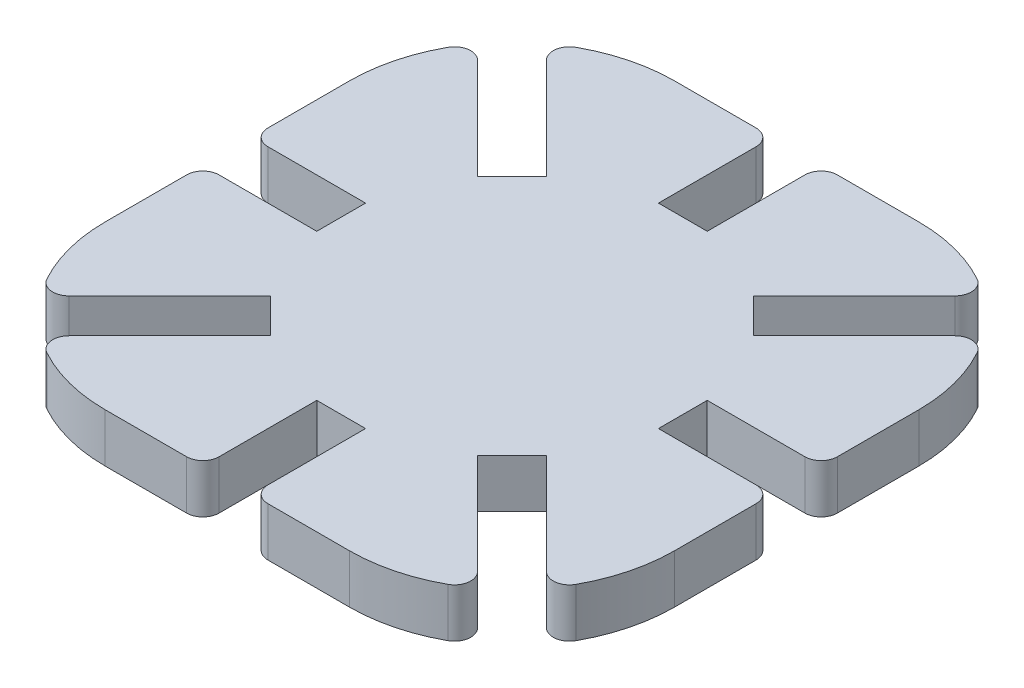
ISO-10303-21;
HEADER;
FILE_DESCRIPTION(('STEP AP214'),'2;1');
FILE_NAME('part.step','',(''),(''),'','','');
FILE_SCHEMA(('AUTOMOTIVE_DESIGN { 1 0 10303 214 1 1 1 1 }'));
ENDSEC;
DATA;
#1=APPLICATION_CONTEXT('core data for automotive mechanical design processes');
#2=APPLICATION_PROTOCOL_DEFINITION('international standard','automotive_design',2000,#1);
#3=PRODUCT_CONTEXT('',#1,'mechanical');
#4=PRODUCT('Part','Part','',(#3));
#5=PRODUCT_RELATED_PRODUCT_CATEGORY('part','',(#4));
#6=PRODUCT_DEFINITION_FORMATION('','',#4);
#7=PRODUCT_DEFINITION_CONTEXT('part definition',#1,'design');
#8=PRODUCT_DEFINITION('design','',#6,#7);
#9=PRODUCT_DEFINITION_SHAPE('','',#8);
#10=(LENGTH_UNIT() NAMED_UNIT(*) SI_UNIT(.MILLI.,.METRE.));
#11=(NAMED_UNIT(*) PLANE_ANGLE_UNIT() SI_UNIT($,.RADIAN.));
#12=(NAMED_UNIT(*) SI_UNIT($,.STERADIAN.) SOLID_ANGLE_UNIT());
#13=UNCERTAINTY_MEASURE_WITH_UNIT(LENGTH_MEASURE(1.E-05),#10,'distance_accuracy_value','');
#14=(GEOMETRIC_REPRESENTATION_CONTEXT(3) GLOBAL_UNCERTAINTY_ASSIGNED_CONTEXT((#13)) GLOBAL_UNIT_ASSIGNED_CONTEXT((#10,
#11,#12)) REPRESENTATION_CONTEXT('',''));
#15=CARTESIAN_POINT('',(0.,0.,0.));
#16=DIRECTION('',(0.,0.,1.));
#17=DIRECTION('',(1.,0.,0.));
#18=AXIS2_PLACEMENT_3D('',#15,#16,#17);
#19=CARTESIAN_POINT('',(35.,6.,-35.));
#20=DIRECTION('',(-1.,0.,0.));
#21=DIRECTION('',(0.,0.,1.));
#22=AXIS2_PLACEMENT_3D('',#19,#20,#21);
#23=PLANE('',#22);
#24=DIRECTION('',(0.,0.,-1.));
#25=VECTOR('',#24,1.);
#26=CARTESIAN_POINT('',(35.,6.,-35.));
#27=LINE('',#26,#25);
#28=CARTESIAN_POINT('',(35.,6.,-5.));
#29=VERTEX_POINT('',#28);
#30=CARTESIAN_POINT('',(35.,6.,-15.));
#31=VERTEX_POINT('',#30);
#32=EDGE_CURVE('E562',#29,#31,#27,.T.);
#33=ORIENTED_EDGE('',*,*,#32,.F.);
#34=DIRECTION('',(0.,-1.,0.));
#35=VECTOR('',#34,1.);
#36=CARTESIAN_POINT('',(35.,6.,-5.));
#37=LINE('',#36,#35);
#38=CARTESIAN_POINT('',(35.,0.,-5.));
#39=VERTEX_POINT('',#38);
#40=EDGE_CURVE('E778',#29,#39,#37,.T.);
#41=ORIENTED_EDGE('',*,*,#40,.T.);
#42=DIRECTION('',(0.,0.,-1.));
#43=VECTOR('',#42,1.);
#44=CARTESIAN_POINT('',(35.,0.,-35.));
#45=LINE('',#44,#43);
#46=CARTESIAN_POINT('',(35.,0.,-15.));
#47=VERTEX_POINT('',#46);
#48=EDGE_CURVE('E556',#39,#47,#45,.T.);
#49=ORIENTED_EDGE('',*,*,#48,.T.);
#50=DIRECTION('',(0.,-1.,0.));
#51=VECTOR('',#50,1.);
#52=CARTESIAN_POINT('',(35.,6.,-15.));
#53=LINE('',#52,#51);
#54=EDGE_CURVE('E636',#47,#31,#53,.F.);
#55=ORIENTED_EDGE('',*,*,#54,.T.);
#56=EDGE_LOOP('',(#33,#41,#49,#55));
#57=FACE_BOUND('',#56,.T.);
#58=ADVANCED_FACE('F33',(#57),#23,.F.);
#59=CARTESIAN_POINT('',(-35.,6.,-35.));
#60=DIRECTION('',(0.,0.,1.));
#61=DIRECTION('',(1.,0.,0.));
#62=AXIS2_PLACEMENT_3D('',#59,#60,#61);
#63=PLANE('',#62);
#64=DIRECTION('',(-1.,0.,0.));
#65=VECTOR('',#64,1.);
#66=CARTESIAN_POINT('',(-35.,6.,-35.));
#67=LINE('',#66,#65);
#68=CARTESIAN_POINT('',(-4.99999999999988,6.,-35.));
#69=VERTEX_POINT('',#68);
#70=CARTESIAN_POINT('',(-15.,6.,-35.));
#71=VERTEX_POINT('',#70);
#72=EDGE_CURVE('E561',#69,#71,#67,.T.);
#73=ORIENTED_EDGE('',*,*,#72,.F.);
#74=DIRECTION('',(0.,-1.,0.));
#75=VECTOR('',#74,1.);
#76=CARTESIAN_POINT('',(-4.99999999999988,6.,-35.));
#77=LINE('',#76,#75);
#78=CARTESIAN_POINT('',(-4.99999999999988,0.,-35.));
#79=VERTEX_POINT('',#78);
#80=EDGE_CURVE('E720',#69,#79,#77,.T.);
#81=ORIENTED_EDGE('',*,*,#80,.T.);
#82=DIRECTION('',(-1.,0.,0.));
#83=VECTOR('',#82,1.);
#84=CARTESIAN_POINT('',(-35.,0.,-35.));
#85=LINE('',#84,#83);
#86=CARTESIAN_POINT('',(-15.,0.,-35.));
#87=VERTEX_POINT('',#86);
#88=EDGE_CURVE('E578',#79,#87,#85,.T.);
#89=ORIENTED_EDGE('',*,*,#88,.T.);
#90=DIRECTION('',(0.,-1.,0.));
#91=VECTOR('',#90,1.);
#92=CARTESIAN_POINT('',(-15.,6.,-35.));
#93=LINE('',#92,#91);
#94=EDGE_CURVE('E614',#87,#71,#93,.F.);
#95=ORIENTED_EDGE('',*,*,#94,.T.);
#96=EDGE_LOOP('',(#73,#81,#89,#95));
#97=FACE_BOUND('',#96,.T.);
#98=ADVANCED_FACE('F897',(#97),#63,.F.);
#99=CARTESIAN_POINT('',(-35.,6.,35.));
#100=DIRECTION('',(0.,0.,-1.));
#101=DIRECTION('',(-1.,0.,0.));
#102=AXIS2_PLACEMENT_3D('',#99,#100,#101);
#103=PLANE('',#102);
#104=DIRECTION('',(1.,0.,0.));
#105=VECTOR('',#104,1.);
#106=CARTESIAN_POINT('',(-35.,6.,35.));
#107=LINE('',#106,#105);
#108=CARTESIAN_POINT('',(4.99999999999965,6.,35.));
#109=VERTEX_POINT('',#108);
#110=CARTESIAN_POINT('',(15.,6.,35.));
#111=VERTEX_POINT('',#110);
#112=EDGE_CURVE('E570',#109,#111,#107,.T.);
#113=ORIENTED_EDGE('',*,*,#112,.F.);
#114=DIRECTION('',(0.,-1.,0.));
#115=VECTOR('',#114,1.);
#116=CARTESIAN_POINT('',(4.99999999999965,6.,35.));
#117=LINE('',#116,#115);
#118=CARTESIAN_POINT('',(4.99999999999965,0.,35.));
#119=VERTEX_POINT('',#118);
#120=EDGE_CURVE('E758',#109,#119,#117,.T.);
#121=ORIENTED_EDGE('',*,*,#120,.T.);
#122=DIRECTION('',(1.,0.,0.));
#123=VECTOR('',#122,1.);
#124=CARTESIAN_POINT('',(-35.,0.,35.));
#125=LINE('',#124,#123);
#126=CARTESIAN_POINT('',(15.,0.,35.));
#127=VERTEX_POINT('',#126);
#128=EDGE_CURVE('E586',#119,#127,#125,.T.);
#129=ORIENTED_EDGE('',*,*,#128,.T.);
#130=DIRECTION('',(0.,-1.,0.));
#131=VECTOR('',#130,1.);
#132=CARTESIAN_POINT('',(15.,6.,35.));
#133=LINE('',#132,#131);
#134=EDGE_CURVE('E642',#127,#111,#133,.F.);
#135=ORIENTED_EDGE('',*,*,#134,.T.);
#136=EDGE_LOOP('',(#113,#121,#129,#135));
#137=FACE_BOUND('',#136,.T.);
#138=ADVANCED_FACE('F878',(#137),#103,.F.);
#139=CARTESIAN_POINT('',(-15.,6.,-15.));
#140=DIRECTION('',(0.,-1.,0.));
#141=DIRECTION('',(0.,0.,-1.));
#142=AXIS2_PLACEMENT_3D('',#139,#140,#141);
#143=CYLINDRICAL_SURFACE('',#142,20.);
#144=CARTESIAN_POINT('',(-15.,6.,-15.));
#145=DIRECTION('',(0.,1.,0.));
#146=DIRECTION('',(0.,0.,1.));
#147=AXIS2_PLACEMENT_3D('',#144,#145,#146);
#148=CIRCLE('',#147,20.);
#149=CARTESIAN_POINT('',(-32.5139479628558,6.,-24.657205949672));
#150=VERTEX_POINT('',#149);
#151=CARTESIAN_POINT('',(-35.,6.,-15.));
#152=VERTEX_POINT('',#151);
#153=EDGE_CURVE('E629',#150,#152,#148,.T.);
#154=ORIENTED_EDGE('',*,*,#153,.F.);
#155=DIRECTION('',(0.,-1.,0.));
#156=VECTOR('',#155,1.);
#157=CARTESIAN_POINT('',(-32.5139479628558,6.,-24.657205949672));
#158=LINE('',#157,#156);
#159=CARTESIAN_POINT('',(-32.5139479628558,0.,-24.657205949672));
#160=VERTEX_POINT('',#159);
#161=EDGE_CURVE('E732',#150,#160,#158,.T.);
#162=ORIENTED_EDGE('',*,*,#161,.T.);
#163=CARTESIAN_POINT('',(-15.,0.,-15.));
#164=DIRECTION('',(0.,1.,0.));
#165=DIRECTION('',(0.,0.,1.));
#166=AXIS2_PLACEMENT_3D('',#163,#164,#165);
#167=CIRCLE('',#166,20.);
#168=CARTESIAN_POINT('',(-35.,0.,-15.));
#169=VERTEX_POINT('',#168);
#170=EDGE_CURVE('E608',#169,#160,#167,.F.);
#171=ORIENTED_EDGE('',*,*,#170,.F.);
#172=DIRECTION('',(0.,-1.,0.));
#173=VECTOR('',#172,1.);
#174=CARTESIAN_POINT('',(-35.,6.,-15.));
#175=LINE('',#174,#173);
#176=EDGE_CURVE('E592',#152,#169,#175,.T.);
#177=ORIENTED_EDGE('',*,*,#176,.F.);
#178=EDGE_LOOP('',(#154,#162,#171,#177));
#179=FACE_BOUND('',#178,.T.);
#180=ADVANCED_FACE('F1026',(#179),#143,.T.);
#181=CARTESIAN_POINT('',(15.,6.,-15.));
#182=DIRECTION('',(0.,-1.,0.));
#183=DIRECTION('',(0.,0.,-1.));
#184=AXIS2_PLACEMENT_3D('',#181,#182,#183);
#185=CYLINDRICAL_SURFACE('',#184,20.);
#186=CARTESIAN_POINT('',(15.,6.,-15.));
#187=DIRECTION('',(0.,1.,0.));
#188=DIRECTION('',(0.,0.,1.));
#189=AXIS2_PLACEMENT_3D('',#186,#187,#188);
#190=CIRCLE('',#189,20.);
#191=CARTESIAN_POINT('',(24.6572059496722,6.,-32.5139479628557));
#192=VERTEX_POINT('',#191);
#193=CARTESIAN_POINT('',(15.,6.,-35.));
#194=VERTEX_POINT('',#193);
#195=EDGE_CURVE('E625',#192,#194,#190,.T.);
#196=ORIENTED_EDGE('',*,*,#195,.F.);
#197=DIRECTION('',(0.,-1.,0.));
#198=VECTOR('',#197,1.);
#199=CARTESIAN_POINT('',(24.6572059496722,6.,-32.5139479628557));
#200=LINE('',#199,#198);
#201=CARTESIAN_POINT('',(24.6572059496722,0.,-32.5139479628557));
#202=VERTEX_POINT('',#201);
#203=EDGE_CURVE('E786',#192,#202,#200,.T.);
#204=ORIENTED_EDGE('',*,*,#203,.T.);
#205=CARTESIAN_POINT('',(15.,0.,-15.));
#206=DIRECTION('',(0.,1.,0.));
#207=DIRECTION('',(0.,0.,1.));
#208=AXIS2_PLACEMENT_3D('',#205,#206,#207);
#209=CIRCLE('',#208,20.);
#210=CARTESIAN_POINT('',(15.,0.,-35.));
#211=VERTEX_POINT('',#210);
#212=EDGE_CURVE('E604',#211,#202,#209,.F.);
#213=ORIENTED_EDGE('',*,*,#212,.F.);
#214=DIRECTION('',(0.,-1.,0.));
#215=VECTOR('',#214,1.);
#216=CARTESIAN_POINT('',(15.,6.,-35.));
#217=LINE('',#216,#215);
#218=EDGE_CURVE('E611',#194,#211,#217,.T.);
#219=ORIENTED_EDGE('',*,*,#218,.F.);
#220=EDGE_LOOP('',(#196,#204,#213,#219));
#221=FACE_BOUND('',#220,.T.);
#222=ADVANCED_FACE('F1023',(#221),#185,.T.);
#223=CARTESIAN_POINT('',(15.,6.,15.));
#224=DIRECTION('',(0.,-1.,0.));
#225=DIRECTION('',(0.,0.,-1.));
#226=AXIS2_PLACEMENT_3D('',#223,#224,#225);
#227=CYLINDRICAL_SURFACE('',#226,20.);
#228=CARTESIAN_POINT('',(15.,6.,15.));
#229=DIRECTION('',(0.,1.,0.));
#230=DIRECTION('',(0.,0.,1.));
#231=AXIS2_PLACEMENT_3D('',#228,#229,#230);
#232=CIRCLE('',#231,20.);
#233=CARTESIAN_POINT('',(32.5139479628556,6.,24.6572059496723));
#234=VERTEX_POINT('',#233);
#235=CARTESIAN_POINT('',(35.,6.,15.));
#236=VERTEX_POINT('',#235);
#237=EDGE_CURVE('E621',#234,#236,#232,.T.);
#238=ORIENTED_EDGE('',*,*,#237,.F.);
#239=DIRECTION('',(0.,-1.,0.));
#240=VECTOR('',#239,1.);
#241=CARTESIAN_POINT('',(32.5139479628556,6.,24.6572059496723));
#242=LINE('',#241,#240);
#243=CARTESIAN_POINT('',(32.5139479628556,0.,24.6572059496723));
#244=VERTEX_POINT('',#243);
#245=EDGE_CURVE('E766',#234,#244,#242,.T.);
#246=ORIENTED_EDGE('',*,*,#245,.T.);
#247=CARTESIAN_POINT('',(15.,0.,15.));
#248=DIRECTION('',(0.,1.,0.));
#249=DIRECTION('',(0.,0.,1.));
#250=AXIS2_PLACEMENT_3D('',#247,#248,#249);
#251=CIRCLE('',#250,20.);
#252=CARTESIAN_POINT('',(35.,0.,15.));
#253=VERTEX_POINT('',#252);
#254=EDGE_CURVE('E600',#253,#244,#251,.F.);
#255=ORIENTED_EDGE('',*,*,#254,.F.);
#256=DIRECTION('',(0.,-1.,0.));
#257=VECTOR('',#256,1.);
#258=CARTESIAN_POINT('',(35.,6.,15.));
#259=LINE('',#258,#257);
#260=EDGE_CURVE('E633',#236,#253,#259,.T.);
#261=ORIENTED_EDGE('',*,*,#260,.F.);
#262=EDGE_LOOP('',(#238,#246,#255,#261));
#263=FACE_BOUND('',#262,.T.);
#264=ADVANCED_FACE('F845',(#263),#227,.T.);
#265=CARTESIAN_POINT('',(-15.,6.,15.));
#266=DIRECTION('',(0.,-1.,0.));
#267=DIRECTION('',(0.,0.,-1.));
#268=AXIS2_PLACEMENT_3D('',#265,#266,#267);
#269=CYLINDRICAL_SURFACE('',#268,20.);
#270=CARTESIAN_POINT('',(-15.,6.,15.));
#271=DIRECTION('',(0.,1.,0.));
#272=DIRECTION('',(0.,0.,1.));
#273=AXIS2_PLACEMENT_3D('',#270,#271,#272);
#274=CIRCLE('',#273,20.);
#275=CARTESIAN_POINT('',(-24.6572059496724,6.,32.5139479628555));
#276=VERTEX_POINT('',#275);
#277=CARTESIAN_POINT('',(-15.,6.,35.));
#278=VERTEX_POINT('',#277);
#279=EDGE_CURVE('E617',#276,#278,#274,.T.);
#280=ORIENTED_EDGE('',*,*,#279,.F.);
#281=DIRECTION('',(0.,-1.,0.));
#282=VECTOR('',#281,1.);
#283=CARTESIAN_POINT('',(-24.6572059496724,6.,32.5139479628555));
#284=LINE('',#283,#282);
#285=CARTESIAN_POINT('',(-24.6572059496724,0.,32.5139479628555));
#286=VERTEX_POINT('',#285);
#287=EDGE_CURVE('E747',#276,#286,#284,.T.);
#288=ORIENTED_EDGE('',*,*,#287,.T.);
#289=CARTESIAN_POINT('',(-15.,0.,15.));
#290=DIRECTION('',(0.,1.,0.));
#291=DIRECTION('',(0.,0.,1.));
#292=AXIS2_PLACEMENT_3D('',#289,#290,#291);
#293=CIRCLE('',#292,20.);
#294=CARTESIAN_POINT('',(-15.,0.,35.));
#295=VERTEX_POINT('',#294);
#296=EDGE_CURVE('E596',#295,#286,#293,.F.);
#297=ORIENTED_EDGE('',*,*,#296,.F.);
#298=DIRECTION('',(0.,-1.,0.));
#299=VECTOR('',#298,1.);
#300=CARTESIAN_POINT('',(-15.,6.,35.));
#301=LINE('',#300,#299);
#302=EDGE_CURVE('E639',#278,#295,#301,.T.);
#303=ORIENTED_EDGE('',*,*,#302,.F.);
#304=EDGE_LOOP('',(#280,#288,#297,#303));
#305=FACE_BOUND('',#304,.T.);
#306=ADVANCED_FACE('F914',(#305),#269,.T.);
#307=CARTESIAN_POINT('',(-35.,6.,-35.));
#308=DIRECTION('',(1.,0.,0.));
#309=DIRECTION('',(0.,0.,-1.));
#310=AXIS2_PLACEMENT_3D('',#307,#308,#309);
#311=PLANE('',#310);
#312=DIRECTION('',(0.,0.,1.));
#313=VECTOR('',#312,1.);
#314=CARTESIAN_POINT('',(-35.,6.,-35.));
#315=LINE('',#314,#313);
#316=CARTESIAN_POINT('',(-35.,6.,5.));
#317=VERTEX_POINT('',#316);
#318=CARTESIAN_POINT('',(-35.,6.,15.));
#319=VERTEX_POINT('',#318);
#320=EDGE_CURVE('E566',#317,#319,#315,.T.);
#321=ORIENTED_EDGE('',*,*,#320,.F.);
#322=DIRECTION('',(0.,-1.,0.));
#323=VECTOR('',#322,1.);
#324=CARTESIAN_POINT('',(-35.,6.,5.));
#325=LINE('',#324,#323);
#326=CARTESIAN_POINT('',(-35.,0.,5.));
#327=VERTEX_POINT('',#326);
#328=EDGE_CURVE('E739',#317,#327,#325,.T.);
#329=ORIENTED_EDGE('',*,*,#328,.T.);
#330=DIRECTION('',(0.,0.,1.));
#331=VECTOR('',#330,1.);
#332=CARTESIAN_POINT('',(-35.,0.,-35.));
#333=LINE('',#332,#331);
#334=CARTESIAN_POINT('',(-35.,0.,15.));
#335=VERTEX_POINT('',#334);
#336=EDGE_CURVE('E582',#327,#335,#333,.T.);
#337=ORIENTED_EDGE('',*,*,#336,.T.);
#338=DIRECTION('',(0.,-1.,0.));
#339=VECTOR('',#338,1.);
#340=CARTESIAN_POINT('',(-35.,6.,15.));
#341=LINE('',#340,#339);
#342=EDGE_CURVE('E574',#335,#319,#341,.F.);
#343=ORIENTED_EDGE('',*,*,#342,.T.);
#344=EDGE_LOOP('',(#321,#329,#337,#343));
#345=FACE_BOUND('',#344,.T.);
#346=ADVANCED_FACE('F907',(#345),#311,.F.);
#347=CARTESIAN_POINT('',(35.,0.,5.));
#348=VERTEX_POINT('',#347);
#349=EDGE_CURVE('E575',#253,#348,#45,.T.);
#350=ORIENTED_EDGE('',*,*,#349,.T.);
#351=DIRECTION('',(0.,1.,0.));
#352=VECTOR('',#351,1.);
#353=CARTESIAN_POINT('',(35.,6.,5.));
#354=LINE('',#353,#352);
#355=CARTESIAN_POINT('',(35.,6.,5.));
#356=VERTEX_POINT('',#355);
#357=EDGE_CURVE('E773',#348,#356,#354,.T.);
#358=ORIENTED_EDGE('',*,*,#357,.T.);
#359=EDGE_CURVE('E558',#236,#356,#27,.T.);
#360=ORIENTED_EDGE('',*,*,#359,.F.);
#361=ORIENTED_EDGE('',*,*,#260,.T.);
#362=EDGE_LOOP('',(#350,#358,#360,#361));
#363=FACE_BOUND('',#362,.T.);
#364=ADVANCED_FACE('F839',(#363),#23,.F.);
#365=CARTESIAN_POINT('',(5.00000000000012,0.,-35.));
#366=VERTEX_POINT('',#365);
#367=EDGE_CURVE('E579',#211,#366,#85,.T.);
#368=ORIENTED_EDGE('',*,*,#367,.T.);
#369=DIRECTION('',(0.,1.,0.));
#370=VECTOR('',#369,1.);
#371=CARTESIAN_POINT('',(5.00000000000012,6.,-35.));
#372=LINE('',#371,#370);
#373=CARTESIAN_POINT('',(5.00000000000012,6.,-35.));
#374=VERTEX_POINT('',#373);
#375=EDGE_CURVE('E652',#366,#374,#372,.T.);
#376=ORIENTED_EDGE('',*,*,#375,.T.);
#377=EDGE_CURVE('E563',#194,#374,#67,.T.);
#378=ORIENTED_EDGE('',*,*,#377,.F.);
#379=ORIENTED_EDGE('',*,*,#218,.T.);
#380=EDGE_LOOP('',(#368,#376,#378,#379));
#381=FACE_BOUND('',#380,.T.);
#382=ADVANCED_FACE('F904',(#381),#63,.F.);
#383=CARTESIAN_POINT('',(-35.,0.,-5.));
#384=VERTEX_POINT('',#383);
#385=EDGE_CURVE('E583',#169,#384,#333,.T.);
#386=ORIENTED_EDGE('',*,*,#385,.T.);
#387=DIRECTION('',(0.,1.,0.));
#388=VECTOR('',#387,1.);
#389=CARTESIAN_POINT('',(-35.,6.,-5.));
#390=LINE('',#389,#388);
#391=CARTESIAN_POINT('',(-35.,6.,-5.));
#392=VERTEX_POINT('',#391);
#393=EDGE_CURVE('E734',#384,#392,#390,.T.);
#394=ORIENTED_EDGE('',*,*,#393,.T.);
#395=EDGE_CURVE('E567',#152,#392,#315,.T.);
#396=ORIENTED_EDGE('',*,*,#395,.F.);
#397=ORIENTED_EDGE('',*,*,#176,.T.);
#398=EDGE_LOOP('',(#386,#394,#396,#397));
#399=FACE_BOUND('',#398,.T.);
#400=ADVANCED_FACE('F912',(#399),#311,.F.);
#401=CARTESIAN_POINT('',(-5.00000000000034,0.,35.));
#402=VERTEX_POINT('',#401);
#403=EDGE_CURVE('E587',#295,#402,#125,.T.);
#404=ORIENTED_EDGE('',*,*,#403,.T.);
#405=DIRECTION('',(0.,1.,0.));
#406=VECTOR('',#405,1.);
#407=CARTESIAN_POINT('',(-5.00000000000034,6.,35.));
#408=LINE('',#407,#406);
#409=CARTESIAN_POINT('',(-5.00000000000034,6.,35.));
#410=VERTEX_POINT('',#409);
#411=EDGE_CURVE('E754',#402,#410,#408,.T.);
#412=ORIENTED_EDGE('',*,*,#411,.T.);
#413=EDGE_CURVE('E571',#278,#410,#107,.T.);
#414=ORIENTED_EDGE('',*,*,#413,.F.);
#415=ORIENTED_EDGE('',*,*,#302,.T.);
#416=EDGE_LOOP('',(#404,#412,#414,#415));
#417=FACE_BOUND('',#416,.T.);
#418=ADVANCED_FACE('F926',(#417),#103,.F.);
#419=CARTESIAN_POINT('',(0.,6.,0.));
#420=DIRECTION('',(0.,1.,0.));
#421=DIRECTION('',(0.,0.,1.));
#422=AXIS2_PLACEMENT_3D('',#419,#420,#421);
#423=PLANE('',#422);
#424=ORIENTED_EDGE('',*,*,#377,.T.);
#425=CARTESIAN_POINT('',(5.00000000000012,6.,-33.));
#426=DIRECTION('',(0.,1.,0.));
#427=DIRECTION('',(0.,0.,1.));
#428=AXIS2_PLACEMENT_3D('',#425,#426,#427);
#429=CIRCLE('',#428,2.);
#430=CARTESIAN_POINT('',(3.00000000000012,6.,-33.));
#431=VERTEX_POINT('',#430);
#432=EDGE_CURVE('E685',#374,#431,#429,.T.);
#433=ORIENTED_EDGE('',*,*,#432,.T.);
#434=DIRECTION('',(0.,0.,-1.));
#435=VECTOR('',#434,1.);
#436=CARTESIAN_POINT('',(3.00000000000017,6.,-49.));
#437=LINE('',#436,#435);
#438=CARTESIAN_POINT('',(3.00000000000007,6.,-21.));
#439=VERTEX_POINT('',#438);
#440=EDGE_CURVE('E450',#439,#431,#437,.T.);
#441=ORIENTED_EDGE('',*,*,#440,.F.);
#442=DIRECTION('',(1.,0.,0.));
#443=VECTOR('',#442,1.);
#444=CARTESIAN_POINT('',(3.00000000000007,6.,-21.));
#445=LINE('',#444,#443);
#446=CARTESIAN_POINT('',(-2.99999999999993,6.,-21.));
#447=VERTEX_POINT('',#446);
#448=EDGE_CURVE('E447',#447,#439,#445,.T.);
#449=ORIENTED_EDGE('',*,*,#448,.F.);
#450=DIRECTION('',(0.,0.,1.));
#451=VECTOR('',#450,1.);
#452=CARTESIAN_POINT('',(-2.99999999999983,6.,-49.));
#453=LINE('',#452,#451);
#454=CARTESIAN_POINT('',(-2.99999999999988,6.,-33.));
#455=VERTEX_POINT('',#454);
#456=EDGE_CURVE('E444',#455,#447,#453,.T.);
#457=ORIENTED_EDGE('',*,*,#456,.F.);
#458=CARTESIAN_POINT('',(-4.99999999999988,6.,-33.));
#459=DIRECTION('',(0.,1.,0.));
#460=DIRECTION('',(0.,0.,1.));
#461=AXIS2_PLACEMENT_3D('',#458,#459,#460);
#462=CIRCLE('',#461,2.);
#463=EDGE_CURVE('E683',#455,#69,#462,.T.);
#464=ORIENTED_EDGE('',*,*,#463,.T.);
#465=ORIENTED_EDGE('',*,*,#72,.T.);
#466=CARTESIAN_POINT('',(-24.6572059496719,6.,-32.5139479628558));
#467=VERTEX_POINT('',#466);
#468=EDGE_CURVE('E630',#71,#467,#148,.T.);
#469=ORIENTED_EDGE('',*,*,#468,.T.);
#470=CARTESIAN_POINT('',(-23.6914853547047,6.,-30.7625531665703));
#471=DIRECTION('',(0.,1.,0.));
#472=DIRECTION('',(0.,0.,1.));
#473=AXIS2_PLACEMENT_3D('',#470,#471,#472);
#474=CIRCLE('',#473,2.);
#475=CARTESIAN_POINT('',(-25.1056989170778,6.,-29.3483396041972));
#476=VERTEX_POINT('',#475);
#477=EDGE_CURVE('E681',#467,#476,#474,.T.);
#478=ORIENTED_EDGE('',*,*,#477,.T.);
#479=DIRECTION('',(-0.707106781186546,0.,-0.707106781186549));
#480=VECTOR('',#479,1.);
#481=CARTESIAN_POINT('',(-32.5269119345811,6.,-36.7695526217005));
#482=LINE('',#481,#480);
#483=CARTESIAN_POINT('',(-12.7279220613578,6.,-16.9705627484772));
#484=VERTEX_POINT('',#483);
#485=EDGE_CURVE('E530',#484,#476,#482,.T.);
#486=ORIENTED_EDGE('',*,*,#485,.F.);
#487=DIRECTION('',(0.707106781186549,0.,-0.707106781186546));
#488=VECTOR('',#487,1.);
#489=CARTESIAN_POINT('',(-12.7279220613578,6.,-16.9705627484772));
#490=LINE('',#489,#488);
#491=CARTESIAN_POINT('',(-16.9705627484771,6.,-12.7279220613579));
#492=VERTEX_POINT('',#491);
#493=EDGE_CURVE('E458',#492,#484,#490,.T.);
#494=ORIENTED_EDGE('',*,*,#493,.F.);
#495=DIRECTION('',(0.707106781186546,0.,0.707106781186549));
#496=VECTOR('',#495,1.);
#497=CARTESIAN_POINT('',(-36.7695526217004,6.,-32.5269119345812));
#498=LINE('',#497,#496);
#499=CARTESIAN_POINT('',(-29.3483396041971,6.,-25.1056989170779));
#500=VERTEX_POINT('',#499);
#501=EDGE_CURVE('E523',#500,#492,#498,.T.);
#502=ORIENTED_EDGE('',*,*,#501,.F.);
#503=CARTESIAN_POINT('',(-30.7625531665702,6.,-23.6914853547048));
#504=DIRECTION('',(0.,1.,0.));
#505=DIRECTION('',(0.,0.,1.));
#506=AXIS2_PLACEMENT_3D('',#503,#504,#505);
#507=CIRCLE('',#506,2.);
#508=EDGE_CURVE('E679',#500,#150,#507,.T.);
#509=ORIENTED_EDGE('',*,*,#508,.T.);
#510=ORIENTED_EDGE('',*,*,#153,.T.);
#511=ORIENTED_EDGE('',*,*,#395,.T.);
#512=CARTESIAN_POINT('',(-33.,6.,-5.));
#513=DIRECTION('',(0.,1.,0.));
#514=DIRECTION('',(0.,0.,1.));
#515=AXIS2_PLACEMENT_3D('',#512,#513,#514);
#516=CIRCLE('',#515,2.);
#517=CARTESIAN_POINT('',(-33.,6.,-3.));
#518=VERTEX_POINT('',#517);
#519=EDGE_CURVE('E677',#392,#518,#516,.T.);
#520=ORIENTED_EDGE('',*,*,#519,.T.);
#521=DIRECTION('',(-1.,0.,0.));
#522=VECTOR('',#521,1.);
#523=CARTESIAN_POINT('',(-49.,6.,-3.));
#524=LINE('',#523,#522);
#525=CARTESIAN_POINT('',(-21.,6.,-3.));
#526=VERTEX_POINT('',#525);
#527=EDGE_CURVE('E549',#526,#518,#524,.T.);
#528=ORIENTED_EDGE('',*,*,#527,.F.);
#529=DIRECTION('',(0.,0.,-1.));
#530=VECTOR('',#529,1.);
#531=CARTESIAN_POINT('',(-21.,6.,-3.));
#532=LINE('',#531,#530);
#533=CARTESIAN_POINT('',(-21.,6.,3.));
#534=VERTEX_POINT('',#533);
#535=EDGE_CURVE('E537',#534,#526,#532,.T.);
#536=ORIENTED_EDGE('',*,*,#535,.F.);
#537=DIRECTION('',(1.,0.,0.));
#538=VECTOR('',#537,1.);
#539=CARTESIAN_POINT('',(-49.,6.,3.));
#540=LINE('',#539,#538);
#541=CARTESIAN_POINT('',(-33.,6.,3.));
#542=VERTEX_POINT('',#541);
#543=EDGE_CURVE('E543',#542,#534,#540,.T.);
#544=ORIENTED_EDGE('',*,*,#543,.F.);
#545=CARTESIAN_POINT('',(-33.,6.,5.));
#546=DIRECTION('',(0.,1.,0.));
#547=DIRECTION('',(0.,0.,1.));
#548=AXIS2_PLACEMENT_3D('',#545,#546,#547);
#549=CIRCLE('',#548,2.);
#550=EDGE_CURVE('E675',#542,#317,#549,.T.);
#551=ORIENTED_EDGE('',*,*,#550,.T.);
#552=ORIENTED_EDGE('',*,*,#320,.T.);
#553=CARTESIAN_POINT('',(-32.5139479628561,6.,24.6572059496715));
#554=VERTEX_POINT('',#553);
#555=EDGE_CURVE('E618',#319,#554,#274,.T.);
#556=ORIENTED_EDGE('',*,*,#555,.T.);
#557=CARTESIAN_POINT('',(-30.7625531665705,6.,23.6914853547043));
#558=DIRECTION('',(0.,1.,0.));
#559=DIRECTION('',(0.,0.,1.));
#560=AXIS2_PLACEMENT_3D('',#557,#558,#559);
#561=CIRCLE('',#560,2.);
#562=CARTESIAN_POINT('',(-29.3483396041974,6.,25.1056989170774));
#563=VERTEX_POINT('',#562);
#564=EDGE_CURVE('E671',#554,#563,#561,.T.);
#565=ORIENTED_EDGE('',*,*,#564,.T.);
#566=DIRECTION('',(-0.707106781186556,0.,0.707106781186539));
#567=VECTOR('',#566,1.);
#568=CARTESIAN_POINT('',(-36.7695526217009,6.,32.5269119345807));
#569=LINE('',#568,#567);
#570=CARTESIAN_POINT('',(-16.9705627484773,6.,12.7279220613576));
#571=VERTEX_POINT('',#570);
#572=EDGE_CURVE('E433',#571,#563,#569,.T.);
#573=ORIENTED_EDGE('',*,*,#572,.F.);
#574=DIRECTION('',(-0.707106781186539,0.,-0.707106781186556));
#575=VECTOR('',#574,1.);
#576=CARTESIAN_POINT('',(-16.9705627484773,6.,12.7279220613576));
#577=LINE('',#576,#575);
#578=CARTESIAN_POINT('',(-12.7279220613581,6.,16.970562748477));
#579=VERTEX_POINT('',#578);
#580=EDGE_CURVE('E430',#579,#571,#577,.T.);
#581=ORIENTED_EDGE('',*,*,#580,.F.);
#582=DIRECTION('',(0.707106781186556,0.,-0.707106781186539));
#583=VECTOR('',#582,1.);
#584=CARTESIAN_POINT('',(-32.5269119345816,6.,36.7695526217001));
#585=LINE('',#584,#583);
#586=CARTESIAN_POINT('',(-25.1056989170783,6.,29.3483396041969));
#587=VERTEX_POINT('',#586);
#588=EDGE_CURVE('E424',#587,#579,#585,.T.);
#589=ORIENTED_EDGE('',*,*,#588,.F.);
#590=CARTESIAN_POINT('',(-23.6914853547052,6.,30.76255316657));
#591=DIRECTION('',(0.,1.,0.));
#592=DIRECTION('',(0.,0.,1.));
#593=AXIS2_PLACEMENT_3D('',#590,#591,#592);
#594=CIRCLE('',#593,2.);
#595=EDGE_CURVE('E673',#587,#276,#594,.T.);
#596=ORIENTED_EDGE('',*,*,#595,.T.);
#597=ORIENTED_EDGE('',*,*,#279,.T.);
#598=ORIENTED_EDGE('',*,*,#413,.T.);
#599=CARTESIAN_POINT('',(-5.00000000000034,6.,33.));
#600=DIRECTION('',(0.,1.,0.));
#601=DIRECTION('',(0.,0.,1.));
#602=AXIS2_PLACEMENT_3D('',#599,#600,#601);
#603=CIRCLE('',#602,2.);
#604=CARTESIAN_POINT('',(-3.00000000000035,6.,33.));
#605=VERTEX_POINT('',#604);
#606=EDGE_CURVE('E669',#410,#605,#603,.T.);
#607=ORIENTED_EDGE('',*,*,#606,.T.);
#608=DIRECTION('',(0.,0.,1.));
#609=VECTOR('',#608,1.);
#610=CARTESIAN_POINT('',(-3.00000000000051,6.,49.));
#611=LINE('',#610,#609);
#612=CARTESIAN_POINT('',(-3.00000000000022,6.,21.));
#613=VERTEX_POINT('',#612);
#614=EDGE_CURVE('E412',#613,#605,#611,.T.);
#615=ORIENTED_EDGE('',*,*,#614,.F.);
#616=DIRECTION('',(-1.,0.,0.));
#617=VECTOR('',#616,1.);
#618=CARTESIAN_POINT('',(-3.00000000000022,6.,21.));
#619=LINE('',#618,#617);
#620=CARTESIAN_POINT('',(2.99999999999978,6.,21.));
#621=VERTEX_POINT('',#620);
#622=EDGE_CURVE('E392',#621,#613,#619,.T.);
#623=ORIENTED_EDGE('',*,*,#622,.F.);
#624=DIRECTION('',(0.,0.,-1.));
#625=VECTOR('',#624,1.);
#626=CARTESIAN_POINT('',(2.99999999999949,6.,49.));
#627=LINE('',#626,#625);
#628=CARTESIAN_POINT('',(2.99999999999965,6.,33.));
#629=VERTEX_POINT('',#628);
#630=EDGE_CURVE('E410',#629,#621,#627,.T.);
#631=ORIENTED_EDGE('',*,*,#630,.F.);
#632=CARTESIAN_POINT('',(4.99999999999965,6.,33.));
#633=DIRECTION('',(0.,1.,0.));
#634=DIRECTION('',(0.,0.,1.));
#635=AXIS2_PLACEMENT_3D('',#632,#633,#634);
#636=CIRCLE('',#635,2.);
#637=EDGE_CURVE('E667',#629,#109,#636,.T.);
#638=ORIENTED_EDGE('',*,*,#637,.T.);
#639=ORIENTED_EDGE('',*,*,#112,.T.);
#640=CARTESIAN_POINT('',(24.6572059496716,6.,32.513947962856));
#641=VERTEX_POINT('',#640);
#642=EDGE_CURVE('E622',#111,#641,#232,.T.);
#643=ORIENTED_EDGE('',*,*,#642,.T.);
#644=CARTESIAN_POINT('',(23.6914853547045,6.,30.7625531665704));
#645=DIRECTION('',(0.,1.,0.));
#646=DIRECTION('',(0.,0.,1.));
#647=AXIS2_PLACEMENT_3D('',#644,#645,#646);
#648=CIRCLE('',#647,2.);
#649=CARTESIAN_POINT('',(25.1056989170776,6.,29.3483396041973));
#650=VERTEX_POINT('',#649);
#651=EDGE_CURVE('E663',#641,#650,#648,.T.);
#652=ORIENTED_EDGE('',*,*,#651,.T.);
#653=DIRECTION('',(0.707106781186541,0.,0.707106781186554));
#654=VECTOR('',#653,1.);
#655=CARTESIAN_POINT('',(32.5269119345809,6.,36.7695526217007));
#656=LINE('',#655,#654);
#657=CARTESIAN_POINT('',(12.7279220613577,6.,16.9705627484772));
#658=VERTEX_POINT('',#657);
#659=EDGE_CURVE('E512',#658,#650,#656,.T.);
#660=ORIENTED_EDGE('',*,*,#659,.F.);
#661=DIRECTION('',(-0.707106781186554,0.,0.707106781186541));
#662=VECTOR('',#661,1.);
#663=CARTESIAN_POINT('',(12.7279220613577,6.,16.9705627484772));
#664=LINE('',#663,#662);
#665=CARTESIAN_POINT('',(16.970562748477,6.,12.727922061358));
#666=VERTEX_POINT('',#665);
#667=EDGE_CURVE('E418',#666,#658,#664,.T.);
#668=ORIENTED_EDGE('',*,*,#667,.F.);
#669=DIRECTION('',(-0.707106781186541,0.,-0.707106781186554));
#670=VECTOR('',#669,1.);
#671=CARTESIAN_POINT('',(36.7695526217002,6.,32.5269119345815));
#672=LINE('',#671,#670);
#673=CARTESIAN_POINT('',(29.348339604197,6.,25.1056989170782));
#674=VERTEX_POINT('',#673);
#675=EDGE_CURVE('E504',#674,#666,#672,.T.);
#676=ORIENTED_EDGE('',*,*,#675,.F.);
#677=CARTESIAN_POINT('',(30.7625531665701,6.,23.6914853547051));
#678=DIRECTION('',(0.,1.,0.));
#679=DIRECTION('',(0.,0.,1.));
#680=AXIS2_PLACEMENT_3D('',#677,#678,#679);
#681=CIRCLE('',#680,2.);
#682=EDGE_CURVE('E665',#674,#234,#681,.T.);
#683=ORIENTED_EDGE('',*,*,#682,.T.);
#684=ORIENTED_EDGE('',*,*,#237,.T.);
#685=ORIENTED_EDGE('',*,*,#359,.T.);
#686=CARTESIAN_POINT('',(33.,6.,5.));
#687=DIRECTION('',(0.,1.,0.));
#688=DIRECTION('',(0.,0.,1.));
#689=AXIS2_PLACEMENT_3D('',#686,#687,#688);
#690=CIRCLE('',#689,2.);
#691=CARTESIAN_POINT('',(33.,6.,3.));
#692=VERTEX_POINT('',#691);
#693=EDGE_CURVE('E661',#356,#692,#690,.T.);
#694=ORIENTED_EDGE('',*,*,#693,.T.);
#695=DIRECTION('',(1.,0.,0.));
#696=VECTOR('',#695,1.);
#697=CARTESIAN_POINT('',(49.,6.,3.));
#698=LINE('',#697,#696);
#699=CARTESIAN_POINT('',(21.,6.,3.));
#700=VERTEX_POINT('',#699);
#701=EDGE_CURVE('E492',#700,#692,#698,.T.);
#702=ORIENTED_EDGE('',*,*,#701,.F.);
#703=DIRECTION('',(0.,0.,1.));
#704=VECTOR('',#703,1.);
#705=CARTESIAN_POINT('',(21.,6.,3.));
#706=LINE('',#705,#704);
#707=CARTESIAN_POINT('',(21.,6.,-3.));
#708=VERTEX_POINT('',#707);
#709=EDGE_CURVE('E489',#708,#700,#706,.T.);
#710=ORIENTED_EDGE('',*,*,#709,.F.);
#711=DIRECTION('',(-1.,0.,0.));
#712=VECTOR('',#711,1.);
#713=CARTESIAN_POINT('',(49.,6.,-3.));
#714=LINE('',#713,#712);
#715=CARTESIAN_POINT('',(33.,6.,-3.));
#716=VERTEX_POINT('',#715);
#717=EDGE_CURVE('E485',#716,#708,#714,.T.);
#718=ORIENTED_EDGE('',*,*,#717,.F.);
#719=CARTESIAN_POINT('',(33.,6.,-5.));
#720=DIRECTION('',(0.,1.,0.));
#721=DIRECTION('',(0.,0.,1.));
#722=AXIS2_PLACEMENT_3D('',#719,#720,#721);
#723=CIRCLE('',#722,2.);
#724=EDGE_CURVE('E659',#716,#29,#723,.T.);
#725=ORIENTED_EDGE('',*,*,#724,.T.);
#726=ORIENTED_EDGE('',*,*,#32,.T.);
#727=CARTESIAN_POINT('',(32.5139479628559,6.,-24.6572059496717));
#728=VERTEX_POINT('',#727);
#729=EDGE_CURVE('E626',#31,#728,#190,.T.);
#730=ORIENTED_EDGE('',*,*,#729,.T.);
#731=CARTESIAN_POINT('',(30.7625531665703,6.,-23.6914853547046));
#732=DIRECTION('',(0.,1.,0.));
#733=DIRECTION('',(0.,0.,1.));
#734=AXIS2_PLACEMENT_3D('',#731,#732,#733);
#735=CIRCLE('',#734,2.);
#736=CARTESIAN_POINT('',(29.3483396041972,6.,-25.1056989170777));
#737=VERTEX_POINT('',#736);
#738=EDGE_CURVE('E655',#728,#737,#735,.T.);
#739=ORIENTED_EDGE('',*,*,#738,.T.);
#740=DIRECTION('',(0.707106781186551,0.,-0.707106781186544));
#741=VECTOR('',#740,1.);
#742=CARTESIAN_POINT('',(36.7695526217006,6.,-32.526911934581));
#743=LINE('',#742,#741);
#744=CARTESIAN_POINT('',(16.9705627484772,6.,-12.7279220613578));
#745=VERTEX_POINT('',#744);
#746=EDGE_CURVE('E473',#745,#737,#743,.T.);
#747=ORIENTED_EDGE('',*,*,#746,.F.);
#748=DIRECTION('',(0.707106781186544,0.,0.707106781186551));
#749=VECTOR('',#748,1.);
#750=CARTESIAN_POINT('',(16.9705627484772,6.,-12.7279220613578));
#751=LINE('',#750,#749);
#752=CARTESIAN_POINT('',(12.7279220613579,6.,-16.9705627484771));
#753=VERTEX_POINT('',#752);
#754=EDGE_CURVE('E470',#753,#745,#751,.T.);
#755=ORIENTED_EDGE('',*,*,#754,.F.);
#756=DIRECTION('',(-0.707106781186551,0.,0.707106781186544));
#757=VECTOR('',#756,1.);
#758=CARTESIAN_POINT('',(32.5269119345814,6.,-36.7695526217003));
#759=LINE('',#758,#757);
#760=CARTESIAN_POINT('',(25.105698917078,6.,-29.348339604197));
#761=VERTEX_POINT('',#760);
#762=EDGE_CURVE('E464',#761,#753,#759,.T.);
#763=ORIENTED_EDGE('',*,*,#762,.F.);
#764=CARTESIAN_POINT('',(23.6914853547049,6.,-30.7625531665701));
#765=DIRECTION('',(0.,1.,0.));
#766=DIRECTION('',(0.,0.,1.));
#767=AXIS2_PLACEMENT_3D('',#764,#765,#766);
#768=CIRCLE('',#767,2.);
#769=EDGE_CURVE('E657',#761,#192,#768,.T.);
#770=ORIENTED_EDGE('',*,*,#769,.T.);
#771=ORIENTED_EDGE('',*,*,#195,.T.);
#772=EDGE_LOOP('',(#424,#433,#441,#449,#457,#464,#465,#469,#478,#486,#494,#502,#509,#510,#511,
#520,#528,#536,#544,#551,#552,#556,#565,#573,#581,#589,#596,#597,#598,#607,#615,#623,#631,#638,
#639,#643,#652,#660,#668,#676,#683,#684,#685,#694,#702,#710,#718,#725,#726,#730,#739,#747,#755,
#763,#770,#771));
#773=FACE_BOUND('',#772,.T.);
#774=ADVANCED_FACE('F805',(#773),#423,.T.);
#775=CARTESIAN_POINT('',(0.,0.,0.));
#776=DIRECTION('',(0.,1.,0.));
#777=DIRECTION('',(0.,0.,1.));
#778=AXIS2_PLACEMENT_3D('',#775,#776,#777);
#779=PLANE('',#778);
#780=DIRECTION('',(0.,0.,-1.));
#781=VECTOR('',#780,1.);
#782=CARTESIAN_POINT('',(3.00000000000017,0.,-49.));
#783=LINE('',#782,#781);
#784=CARTESIAN_POINT('',(3.00000000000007,0.,-21.));
#785=VERTEX_POINT('',#784);
#786=CARTESIAN_POINT('',(3.00000000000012,0.,-33.));
#787=VERTEX_POINT('',#786);
#788=EDGE_CURVE('E443',#785,#787,#783,.T.);
#789=ORIENTED_EDGE('',*,*,#788,.T.);
#790=CARTESIAN_POINT('',(5.00000000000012,0.,-33.));
#791=DIRECTION('',(0.,1.,0.));
#792=DIRECTION('',(0.,0.,1.));
#793=AXIS2_PLACEMENT_3D('',#790,#791,#792);
#794=CIRCLE('',#793,2.);
#795=EDGE_CURVE('E718',#787,#366,#794,.F.);
#796=ORIENTED_EDGE('',*,*,#795,.T.);
#797=ORIENTED_EDGE('',*,*,#367,.F.);
#798=ORIENTED_EDGE('',*,*,#212,.T.);
#799=CARTESIAN_POINT('',(23.6914853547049,0.,-30.7625531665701));
#800=DIRECTION('',(0.,1.,0.));
#801=DIRECTION('',(0.,0.,1.));
#802=AXIS2_PLACEMENT_3D('',#799,#800,#801);
#803=CIRCLE('',#802,2.);
#804=CARTESIAN_POINT('',(25.105698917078,0.,-29.348339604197));
#805=VERTEX_POINT('',#804);
#806=EDGE_CURVE('E691',#202,#805,#803,.F.);
#807=ORIENTED_EDGE('',*,*,#806,.T.);
#808=DIRECTION('',(-0.707106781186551,0.,0.707106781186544));
#809=VECTOR('',#808,1.);
#810=CARTESIAN_POINT('',(32.5269119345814,0.,-36.7695526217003));
#811=LINE('',#810,#809);
#812=CARTESIAN_POINT('',(12.7279220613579,0.,-16.9705627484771));
#813=VERTEX_POINT('',#812);
#814=EDGE_CURVE('E467',#805,#813,#811,.T.);
#815=ORIENTED_EDGE('',*,*,#814,.T.);
#816=DIRECTION('',(0.707106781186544,0.,0.707106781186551));
#817=VECTOR('',#816,1.);
#818=CARTESIAN_POINT('',(16.9705627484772,0.,-12.7279220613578));
#819=LINE('',#818,#817);
#820=CARTESIAN_POINT('',(16.9705627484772,0.,-12.7279220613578));
#821=VERTEX_POINT('',#820);
#822=EDGE_CURVE('E460',#813,#821,#819,.T.);
#823=ORIENTED_EDGE('',*,*,#822,.T.);
#824=DIRECTION('',(0.707106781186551,0.,-0.707106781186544));
#825=VECTOR('',#824,1.);
#826=CARTESIAN_POINT('',(36.7695526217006,0.,-32.526911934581));
#827=LINE('',#826,#825);
#828=CARTESIAN_POINT('',(29.3483396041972,0.,-25.1056989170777));
#829=VERTEX_POINT('',#828);
#830=EDGE_CURVE('E463',#821,#829,#827,.T.);
#831=ORIENTED_EDGE('',*,*,#830,.T.);
#832=CARTESIAN_POINT('',(30.7625531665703,0.,-23.6914853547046));
#833=DIRECTION('',(0.,1.,0.));
#834=DIRECTION('',(0.,0.,1.));
#835=AXIS2_PLACEMENT_3D('',#832,#833,#834);
#836=CIRCLE('',#835,2.);
#837=CARTESIAN_POINT('',(32.5139479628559,0.,-24.6572059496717));
#838=VERTEX_POINT('',#837);
#839=EDGE_CURVE('E689',#829,#838,#836,.F.);
#840=ORIENTED_EDGE('',*,*,#839,.T.);
#841=EDGE_CURVE('E603',#838,#47,#209,.F.);
#842=ORIENTED_EDGE('',*,*,#841,.T.);
#843=ORIENTED_EDGE('',*,*,#48,.F.);
#844=CARTESIAN_POINT('',(33.,0.,-5.));
#845=DIRECTION('',(0.,1.,0.));
#846=DIRECTION('',(0.,0.,1.));
#847=AXIS2_PLACEMENT_3D('',#844,#845,#846);
#848=CIRCLE('',#847,2.);
#849=CARTESIAN_POINT('',(33.,0.,-3.));
#850=VERTEX_POINT('',#849);
#851=EDGE_CURVE('E693',#39,#850,#848,.F.);
#852=ORIENTED_EDGE('',*,*,#851,.T.);
#853=DIRECTION('',(-1.,0.,0.));
#854=VECTOR('',#853,1.);
#855=CARTESIAN_POINT('',(0.,0.,-3.));
#856=LINE('',#855,#854);
#857=CARTESIAN_POINT('',(21.,0.,-3.));
#858=VERTEX_POINT('',#857);
#859=EDGE_CURVE('E648',#850,#858,#856,.T.);
#860=ORIENTED_EDGE('',*,*,#859,.T.);
#861=DIRECTION('',(0.,0.,1.));
#862=VECTOR('',#861,1.);
#863=CARTESIAN_POINT('',(21.,0.,3.));
#864=LINE('',#863,#862);
#865=CARTESIAN_POINT('',(21.,0.,3.));
#866=VERTEX_POINT('',#865);
#867=EDGE_CURVE('E481',#858,#866,#864,.T.);
#868=ORIENTED_EDGE('',*,*,#867,.T.);
#869=DIRECTION('',(1.,0.,0.));
#870=VECTOR('',#869,1.);
#871=CARTESIAN_POINT('',(49.,0.,3.));
#872=LINE('',#871,#870);
#873=CARTESIAN_POINT('',(33.,0.,3.));
#874=VERTEX_POINT('',#873);
#875=EDGE_CURVE('E484',#866,#874,#872,.T.);
#876=ORIENTED_EDGE('',*,*,#875,.T.);
#877=CARTESIAN_POINT('',(33.,0.,5.));
#878=DIRECTION('',(0.,1.,0.));
#879=DIRECTION('',(0.,0.,1.));
#880=AXIS2_PLACEMENT_3D('',#877,#878,#879);
#881=CIRCLE('',#880,2.);
#882=EDGE_CURVE('E695',#874,#348,#881,.F.);
#883=ORIENTED_EDGE('',*,*,#882,.T.);
#884=ORIENTED_EDGE('',*,*,#349,.F.);
#885=ORIENTED_EDGE('',*,*,#254,.T.);
#886=CARTESIAN_POINT('',(30.7625531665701,0.,23.6914853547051));
#887=DIRECTION('',(0.,1.,0.));
#888=DIRECTION('',(0.,0.,1.));
#889=AXIS2_PLACEMENT_3D('',#886,#887,#888);
#890=CIRCLE('',#889,2.);
#891=CARTESIAN_POINT('',(29.348339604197,0.,25.1056989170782));
#892=VERTEX_POINT('',#891);
#893=EDGE_CURVE('E699',#244,#892,#890,.F.);
#894=ORIENTED_EDGE('',*,*,#893,.T.);
#895=DIRECTION('',(-0.707106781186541,0.,-0.707106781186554));
#896=VECTOR('',#895,1.);
#897=CARTESIAN_POINT('',(36.7695526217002,0.,32.5269119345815));
#898=LINE('',#897,#896);
#899=CARTESIAN_POINT('',(16.970562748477,0.,12.727922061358));
#900=VERTEX_POINT('',#899);
#901=EDGE_CURVE('E507',#892,#900,#898,.T.);
#902=ORIENTED_EDGE('',*,*,#901,.T.);
#903=DIRECTION('',(-0.707106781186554,0.,0.707106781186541));
#904=VECTOR('',#903,1.);
#905=CARTESIAN_POINT('',(12.7279220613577,0.,16.9705627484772));
#906=LINE('',#905,#904);
#907=CARTESIAN_POINT('',(12.7279220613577,0.,16.9705627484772));
#908=VERTEX_POINT('',#907);
#909=EDGE_CURVE('E500',#900,#908,#906,.T.);
#910=ORIENTED_EDGE('',*,*,#909,.T.);
#911=DIRECTION('',(0.707106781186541,0.,0.707106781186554));
#912=VECTOR('',#911,1.);
#913=CARTESIAN_POINT('',(32.5269119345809,0.,36.7695526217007));
#914=LINE('',#913,#912);
#915=CARTESIAN_POINT('',(25.1056989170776,0.,29.3483396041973));
#916=VERTEX_POINT('',#915);
#917=EDGE_CURVE('E503',#908,#916,#914,.T.);
#918=ORIENTED_EDGE('',*,*,#917,.T.);
#919=CARTESIAN_POINT('',(23.6914853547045,0.,30.7625531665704));
#920=DIRECTION('',(0.,1.,0.));
#921=DIRECTION('',(0.,0.,1.));
#922=AXIS2_PLACEMENT_3D('',#919,#920,#921);
#923=CIRCLE('',#922,2.);
#924=CARTESIAN_POINT('',(24.6572059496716,0.,32.513947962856));
#925=VERTEX_POINT('',#924);
#926=EDGE_CURVE('E697',#916,#925,#923,.F.);
#927=ORIENTED_EDGE('',*,*,#926,.T.);
#928=EDGE_CURVE('E599',#925,#127,#251,.F.);
#929=ORIENTED_EDGE('',*,*,#928,.T.);
#930=ORIENTED_EDGE('',*,*,#128,.F.);
#931=CARTESIAN_POINT('',(4.99999999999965,0.,33.));
#932=DIRECTION('',(0.,1.,0.));
#933=DIRECTION('',(0.,0.,1.));
#934=AXIS2_PLACEMENT_3D('',#931,#932,#933);
#935=CIRCLE('',#934,2.);
#936=CARTESIAN_POINT('',(2.99999999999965,0.,33.));
#937=VERTEX_POINT('',#936);
#938=EDGE_CURVE('E701',#119,#937,#935,.F.);
#939=ORIENTED_EDGE('',*,*,#938,.T.);
#940=DIRECTION('',(0.,0.,-1.));
#941=VECTOR('',#940,1.);
#942=CARTESIAN_POINT('',(3.,0.,0.));
#943=LINE('',#942,#941);
#944=CARTESIAN_POINT('',(2.99999999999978,0.,21.));
#945=VERTEX_POINT('',#944);
#946=EDGE_CURVE('E408',#937,#945,#943,.T.);
#947=ORIENTED_EDGE('',*,*,#946,.T.);
#948=DIRECTION('',(-1.,0.,0.));
#949=VECTOR('',#948,1.);
#950=CARTESIAN_POINT('',(-3.00000000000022,0.,21.));
#951=LINE('',#950,#949);
#952=CARTESIAN_POINT('',(-3.00000000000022,0.,21.));
#953=VERTEX_POINT('',#952);
#954=EDGE_CURVE('E390',#945,#953,#951,.T.);
#955=ORIENTED_EDGE('',*,*,#954,.T.);
#956=DIRECTION('',(0.,0.,1.));
#957=VECTOR('',#956,1.);
#958=CARTESIAN_POINT('',(-3.00000000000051,0.,49.));
#959=LINE('',#958,#957);
#960=CARTESIAN_POINT('',(-3.00000000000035,0.,33.));
#961=VERTEX_POINT('',#960);
#962=EDGE_CURVE('E397',#953,#961,#959,.T.);
#963=ORIENTED_EDGE('',*,*,#962,.T.);
#964=CARTESIAN_POINT('',(-5.00000000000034,0.,33.));
#965=DIRECTION('',(0.,1.,0.));
#966=DIRECTION('',(0.,0.,1.));
#967=AXIS2_PLACEMENT_3D('',#964,#965,#966);
#968=CIRCLE('',#967,2.);
#969=EDGE_CURVE('E703',#961,#402,#968,.F.);
#970=ORIENTED_EDGE('',*,*,#969,.T.);
#971=ORIENTED_EDGE('',*,*,#403,.F.);
#972=ORIENTED_EDGE('',*,*,#296,.T.);
#973=CARTESIAN_POINT('',(-23.6914853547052,0.,30.76255316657));
#974=DIRECTION('',(0.,1.,0.));
#975=DIRECTION('',(0.,0.,1.));
#976=AXIS2_PLACEMENT_3D('',#973,#974,#975);
#977=CIRCLE('',#976,2.);
#978=CARTESIAN_POINT('',(-25.1056989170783,0.,29.3483396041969));
#979=VERTEX_POINT('',#978);
#980=EDGE_CURVE('E707',#286,#979,#977,.F.);
#981=ORIENTED_EDGE('',*,*,#980,.T.);
#982=DIRECTION('',(0.707106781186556,0.,-0.707106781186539));
#983=VECTOR('',#982,1.);
#984=CARTESIAN_POINT('',(-32.5269119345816,0.,36.7695526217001));
#985=LINE('',#984,#983);
#986=CARTESIAN_POINT('',(-12.7279220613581,0.,16.970562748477));
#987=VERTEX_POINT('',#986);
#988=EDGE_CURVE('E427',#979,#987,#985,.T.);
#989=ORIENTED_EDGE('',*,*,#988,.T.);
#990=DIRECTION('',(-0.707106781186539,0.,-0.707106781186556));
#991=VECTOR('',#990,1.);
#992=CARTESIAN_POINT('',(-16.9705627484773,0.,12.7279220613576));
#993=LINE('',#992,#991);
#994=CARTESIAN_POINT('',(-16.9705627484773,0.,12.7279220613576));
#995=VERTEX_POINT('',#994);
#996=EDGE_CURVE('E420',#987,#995,#993,.T.);
#997=ORIENTED_EDGE('',*,*,#996,.T.);
#998=DIRECTION('',(-0.707106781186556,0.,0.707106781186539));
#999=VECTOR('',#998,1.);
#1000=CARTESIAN_POINT('',(-36.7695526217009,0.,32.5269119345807));
#1001=LINE('',#1000,#999);
#1002=CARTESIAN_POINT('',(-29.3483396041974,0.,25.1056989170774));
#1003=VERTEX_POINT('',#1002);
#1004=EDGE_CURVE('E423',#995,#1003,#1001,.T.);
#1005=ORIENTED_EDGE('',*,*,#1004,.T.);
#1006=CARTESIAN_POINT('',(-30.7625531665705,0.,23.6914853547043));
#1007=DIRECTION('',(0.,1.,0.));
#1008=DIRECTION('',(0.,0.,1.));
#1009=AXIS2_PLACEMENT_3D('',#1006,#1007,#1008);
#1010=CIRCLE('',#1009,2.);
#1011=CARTESIAN_POINT('',(-32.5139479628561,0.,24.6572059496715));
#1012=VERTEX_POINT('',#1011);
#1013=EDGE_CURVE('E705',#1003,#1012,#1010,.F.);
#1014=ORIENTED_EDGE('',*,*,#1013,.T.);
#1015=EDGE_CURVE('E595',#1012,#335,#293,.F.);
#1016=ORIENTED_EDGE('',*,*,#1015,.T.);
#1017=ORIENTED_EDGE('',*,*,#336,.F.);
#1018=CARTESIAN_POINT('',(-33.,0.,5.));
#1019=DIRECTION('',(0.,1.,0.));
#1020=DIRECTION('',(0.,0.,1.));
#1021=AXIS2_PLACEMENT_3D('',#1018,#1019,#1020);
#1022=CIRCLE('',#1021,2.);
#1023=CARTESIAN_POINT('',(-33.,0.,3.));
#1024=VERTEX_POINT('',#1023);
#1025=EDGE_CURVE('E709',#327,#1024,#1022,.F.);
#1026=ORIENTED_EDGE('',*,*,#1025,.T.);
#1027=DIRECTION('',(1.,0.,0.));
#1028=VECTOR('',#1027,1.);
#1029=CARTESIAN_POINT('',(0.,0.,3.));
#1030=LINE('',#1029,#1028);
#1031=CARTESIAN_POINT('',(-21.,0.,3.));
#1032=VERTEX_POINT('',#1031);
#1033=EDGE_CURVE('E645',#1024,#1032,#1030,.T.);
#1034=ORIENTED_EDGE('',*,*,#1033,.T.);
#1035=DIRECTION('',(0.,0.,-1.));
#1036=VECTOR('',#1035,1.);
#1037=CARTESIAN_POINT('',(-21.,0.,-3.));
#1038=LINE('',#1037,#1036);
#1039=CARTESIAN_POINT('',(-21.,0.,-3.));
#1040=VERTEX_POINT('',#1039);
#1041=EDGE_CURVE('E539',#1032,#1040,#1038,.T.);
#1042=ORIENTED_EDGE('',*,*,#1041,.T.);
#1043=DIRECTION('',(-1.,0.,0.));
#1044=VECTOR('',#1043,1.);
#1045=CARTESIAN_POINT('',(-49.,0.,-3.));
#1046=LINE('',#1045,#1044);
#1047=CARTESIAN_POINT('',(-33.,0.,-3.));
#1048=VERTEX_POINT('',#1047);
#1049=EDGE_CURVE('E542',#1040,#1048,#1046,.T.);
#1050=ORIENTED_EDGE('',*,*,#1049,.T.);
#1051=CARTESIAN_POINT('',(-33.,0.,-5.));
#1052=DIRECTION('',(0.,1.,0.));
#1053=DIRECTION('',(0.,0.,1.));
#1054=AXIS2_PLACEMENT_3D('',#1051,#1052,#1053);
#1055=CIRCLE('',#1054,2.);
#1056=EDGE_CURVE('E711',#1048,#384,#1055,.F.);
#1057=ORIENTED_EDGE('',*,*,#1056,.T.);
#1058=ORIENTED_EDGE('',*,*,#385,.F.);
#1059=ORIENTED_EDGE('',*,*,#170,.T.);
#1060=CARTESIAN_POINT('',(-30.7625531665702,0.,-23.6914853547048));
#1061=DIRECTION('',(0.,1.,0.));
#1062=DIRECTION('',(0.,0.,1.));
#1063=AXIS2_PLACEMENT_3D('',#1060,#1061,#1062);
#1064=CIRCLE('',#1063,2.);
#1065=CARTESIAN_POINT('',(-29.3483396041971,0.,-25.1056989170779));
#1066=VERTEX_POINT('',#1065);
#1067=EDGE_CURVE('E713',#160,#1066,#1064,.F.);
#1068=ORIENTED_EDGE('',*,*,#1067,.T.);
#1069=DIRECTION('',(0.707106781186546,0.,0.707106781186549));
#1070=VECTOR('',#1069,1.);
#1071=CARTESIAN_POINT('',(-36.7695526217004,0.,-32.5269119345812));
#1072=LINE('',#1071,#1070);
#1073=CARTESIAN_POINT('',(-16.9705627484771,0.,-12.7279220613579));
#1074=VERTEX_POINT('',#1073);
#1075=EDGE_CURVE('E525',#1066,#1074,#1072,.T.);
#1076=ORIENTED_EDGE('',*,*,#1075,.T.);
#1077=DIRECTION('',(0.707106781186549,0.,-0.707106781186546));
#1078=VECTOR('',#1077,1.);
#1079=CARTESIAN_POINT('',(-12.7279220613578,0.,-16.9705627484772));
#1080=LINE('',#1079,#1078);
#1081=CARTESIAN_POINT('',(-12.7279220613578,0.,-16.9705627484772));
#1082=VERTEX_POINT('',#1081);
#1083=EDGE_CURVE('E519',#1074,#1082,#1080,.T.);
#1084=ORIENTED_EDGE('',*,*,#1083,.T.);
#1085=DIRECTION('',(-0.707106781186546,0.,-0.707106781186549));
#1086=VECTOR('',#1085,1.);
#1087=CARTESIAN_POINT('',(-32.5269119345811,0.,-36.7695526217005));
#1088=LINE('',#1087,#1086);
#1089=CARTESIAN_POINT('',(-25.1056989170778,0.,-29.3483396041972));
#1090=VERTEX_POINT('',#1089);
#1091=EDGE_CURVE('E522',#1082,#1090,#1088,.T.);
#1092=ORIENTED_EDGE('',*,*,#1091,.T.);
#1093=CARTESIAN_POINT('',(-23.6914853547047,0.,-30.7625531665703));
#1094=DIRECTION('',(0.,1.,0.));
#1095=DIRECTION('',(0.,0.,1.));
#1096=AXIS2_PLACEMENT_3D('',#1093,#1094,#1095);
#1097=CIRCLE('',#1096,2.);
#1098=CARTESIAN_POINT('',(-24.6572059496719,0.,-32.5139479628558));
#1099=VERTEX_POINT('',#1098);
#1100=EDGE_CURVE('E48',#1090,#1099,#1097,.F.);
#1101=ORIENTED_EDGE('',*,*,#1100,.T.);
#1102=EDGE_CURVE('E607',#1099,#87,#167,.F.);
#1103=ORIENTED_EDGE('',*,*,#1102,.T.);
#1104=ORIENTED_EDGE('',*,*,#88,.F.);
#1105=CARTESIAN_POINT('',(-4.99999999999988,0.,-33.));
#1106=DIRECTION('',(0.,1.,0.));
#1107=DIRECTION('',(0.,0.,1.));
#1108=AXIS2_PLACEMENT_3D('',#1105,#1106,#1107);
#1109=CIRCLE('',#1108,2.);
#1110=CARTESIAN_POINT('',(-2.99999999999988,0.,-33.));
#1111=VERTEX_POINT('',#1110);
#1112=EDGE_CURVE('E716',#79,#1111,#1109,.F.);
#1113=ORIENTED_EDGE('',*,*,#1112,.T.);
#1114=DIRECTION('',(0.,0.,1.));
#1115=VECTOR('',#1114,1.);
#1116=CARTESIAN_POINT('',(-3.,0.,0.));
#1117=LINE('',#1116,#1115);
#1118=CARTESIAN_POINT('',(-2.99999999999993,0.,-21.));
#1119=VERTEX_POINT('',#1118);
#1120=EDGE_CURVE('E650',#1111,#1119,#1117,.T.);
#1121=ORIENTED_EDGE('',*,*,#1120,.T.);
#1122=DIRECTION('',(1.,0.,0.));
#1123=VECTOR('',#1122,1.);
#1124=CARTESIAN_POINT('',(3.00000000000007,0.,-21.));
#1125=LINE('',#1124,#1123);
#1126=EDGE_CURVE('E440',#1119,#785,#1125,.T.);
#1127=ORIENTED_EDGE('',*,*,#1126,.T.);
#1128=EDGE_LOOP('',(#789,#796,#797,#798,#807,#815,#823,#831,#840,#842,#843,#852,#860,#868,#876,
#883,#884,#885,#894,#902,#910,#918,#927,#929,#930,#939,#947,#955,#963,#970,#971,#972,#981,#989,
#997,#1005,#1014,#1016,#1017,#1026,#1034,#1042,#1050,#1057,#1058,#1059,#1068,#1076,#1084,#1092,
#1101,#1103,#1104,#1113,#1121,#1127));
#1129=FACE_BOUND('',#1128,.T.);
#1130=ADVANCED_FACE('F406',(#1129),#779,.F.);
#1131=ORIENTED_EDGE('',*,*,#1102,.F.);
#1132=DIRECTION('',(0.,-1.,0.));
#1133=VECTOR('',#1132,1.);
#1134=CARTESIAN_POINT('',(-24.6572059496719,6.,-32.5139479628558));
#1135=LINE('',#1134,#1133);
#1136=EDGE_CURVE('E727',#1099,#467,#1135,.F.);
#1137=ORIENTED_EDGE('',*,*,#1136,.T.);
#1138=ORIENTED_EDGE('',*,*,#468,.F.);
#1139=ORIENTED_EDGE('',*,*,#94,.F.);
#1140=EDGE_LOOP('',(#1131,#1137,#1138,#1139));
#1141=FACE_BOUND('',#1140,.T.);
#1142=ADVANCED_FACE('F1022',(#1141),#143,.T.);
#1143=ORIENTED_EDGE('',*,*,#841,.F.);
#1144=DIRECTION('',(0.,-1.,0.));
#1145=VECTOR('',#1144,1.);
#1146=CARTESIAN_POINT('',(32.5139479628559,6.,-24.6572059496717));
#1147=LINE('',#1146,#1145);
#1148=EDGE_CURVE('E11',#838,#728,#1147,.F.);
#1149=ORIENTED_EDGE('',*,*,#1148,.T.);
#1150=ORIENTED_EDGE('',*,*,#729,.F.);
#1151=ORIENTED_EDGE('',*,*,#54,.F.);
#1152=EDGE_LOOP('',(#1143,#1149,#1150,#1151));
#1153=FACE_BOUND('',#1152,.T.);
#1154=ADVANCED_FACE('F809',(#1153),#185,.T.);
#1155=ORIENTED_EDGE('',*,*,#928,.F.);
#1156=DIRECTION('',(0.,-1.,0.));
#1157=VECTOR('',#1156,1.);
#1158=CARTESIAN_POINT('',(24.6572059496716,6.,32.513947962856));
#1159=LINE('',#1158,#1157);
#1160=EDGE_CURVE('E771',#925,#641,#1159,.F.);
#1161=ORIENTED_EDGE('',*,*,#1160,.T.);
#1162=ORIENTED_EDGE('',*,*,#642,.F.);
#1163=ORIENTED_EDGE('',*,*,#134,.F.);
#1164=EDGE_LOOP('',(#1155,#1161,#1162,#1163));
#1165=FACE_BOUND('',#1164,.T.);
#1166=ADVANCED_FACE('F871',(#1165),#227,.T.);
#1167=ORIENTED_EDGE('',*,*,#1015,.F.);
#1168=DIRECTION('',(0.,-1.,0.));
#1169=VECTOR('',#1168,1.);
#1170=CARTESIAN_POINT('',(-32.5139479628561,6.,24.6572059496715));
#1171=LINE('',#1170,#1169);
#1172=EDGE_CURVE('E752',#1012,#554,#1171,.F.);
#1173=ORIENTED_EDGE('',*,*,#1172,.T.);
#1174=ORIENTED_EDGE('',*,*,#555,.F.);
#1175=ORIENTED_EDGE('',*,*,#342,.F.);
#1176=EDGE_LOOP('',(#1167,#1173,#1174,#1175));
#1177=FACE_BOUND('',#1176,.T.);
#1178=ADVANCED_FACE('F922',(#1177),#269,.T.);
#1179=CARTESIAN_POINT('',(-49.,0.,3.));
#1180=DIRECTION('',(0.,0.,1.));
#1181=DIRECTION('',(1.,0.,0.));
#1182=AXIS2_PLACEMENT_3D('',#1179,#1180,#1181);
#1183=PLANE('',#1182);
#1184=ORIENTED_EDGE('',*,*,#1033,.F.);
#1185=DIRECTION('',(0.,-1.,0.));
#1186=VECTOR('',#1185,1.);
#1187=CARTESIAN_POINT('',(-33.,0.,3.));
#1188=LINE('',#1187,#1186);
#1189=EDGE_CURVE('E742',#1024,#542,#1188,.F.);
#1190=ORIENTED_EDGE('',*,*,#1189,.T.);
#1191=ORIENTED_EDGE('',*,*,#543,.T.);
#1192=DIRECTION('',(0.,1.,0.));
#1193=VECTOR('',#1192,1.);
#1194=CARTESIAN_POINT('',(-21.,0.,3.));
#1195=LINE('',#1194,#1193);
#1196=EDGE_CURVE('E553',#1032,#534,#1195,.T.);
#1197=ORIENTED_EDGE('',*,*,#1196,.F.);
#1198=EDGE_LOOP('',(#1184,#1190,#1191,#1197));
#1199=FACE_BOUND('',#1198,.T.);
#1200=ADVANCED_FACE('F1018',(#1199),#1183,.F.);
#1201=CARTESIAN_POINT('',(-49.,0.,-3.));
#1202=DIRECTION('',(0.,0.,-1.));
#1203=DIRECTION('',(-1.,0.,0.));
#1204=AXIS2_PLACEMENT_3D('',#1201,#1202,#1203);
#1205=PLANE('',#1204);
#1206=ORIENTED_EDGE('',*,*,#527,.T.);
#1207=DIRECTION('',(0.,1.,0.));
#1208=VECTOR('',#1207,1.);
#1209=CARTESIAN_POINT('',(-33.,0.,-3.));
#1210=LINE('',#1209,#1208);
#1211=EDGE_CURVE('E737',#518,#1048,#1210,.F.);
#1212=ORIENTED_EDGE('',*,*,#1211,.T.);
#1213=ORIENTED_EDGE('',*,*,#1049,.F.);
#1214=DIRECTION('',(0.,1.,0.));
#1215=VECTOR('',#1214,1.);
#1216=CARTESIAN_POINT('',(-21.,0.,-3.));
#1217=LINE('',#1216,#1215);
#1218=EDGE_CURVE('E546',#1040,#526,#1217,.T.);
#1219=ORIENTED_EDGE('',*,*,#1218,.T.);
#1220=EDGE_LOOP('',(#1206,#1212,#1213,#1219));
#1221=FACE_BOUND('',#1220,.T.);
#1222=ADVANCED_FACE('F943',(#1221),#1205,.F.);
#1223=CARTESIAN_POINT('',(-21.,0.,-3.));
#1224=DIRECTION('',(1.,0.,0.));
#1225=DIRECTION('',(0.,0.,-1.));
#1226=AXIS2_PLACEMENT_3D('',#1223,#1224,#1225);
#1227=PLANE('',#1226);
#1228=ORIENTED_EDGE('',*,*,#535,.T.);
#1229=ORIENTED_EDGE('',*,*,#1218,.F.);
#1230=ORIENTED_EDGE('',*,*,#1041,.F.);
#1231=ORIENTED_EDGE('',*,*,#1196,.T.);
#1232=EDGE_LOOP('',(#1228,#1229,#1230,#1231));
#1233=FACE_BOUND('',#1232,.T.);
#1234=ADVANCED_FACE('F947',(#1233),#1227,.F.);
#1235=CARTESIAN_POINT('',(-16.9705627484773,0.,12.7279220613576));
#1236=DIRECTION('',(0.707106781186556,0.,-0.707106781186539));
#1237=DIRECTION('',(-0.707106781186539,0.,-0.707106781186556));
#1238=AXIS2_PLACEMENT_3D('',#1235,#1236,#1237);
#1239=PLANE('',#1238);
#1240=ORIENTED_EDGE('',*,*,#580,.T.);
#1241=DIRECTION('',(0.,1.,0.));
#1242=VECTOR('',#1241,1.);
#1243=CARTESIAN_POINT('',(-16.9705627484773,0.,12.7279220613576));
#1244=LINE('',#1243,#1242);
#1245=EDGE_CURVE('E429',#995,#571,#1244,.T.);
#1246=ORIENTED_EDGE('',*,*,#1245,.F.);
#1247=ORIENTED_EDGE('',*,*,#996,.F.);
#1248=DIRECTION('',(0.,1.,0.));
#1249=VECTOR('',#1248,1.);
#1250=CARTESIAN_POINT('',(-12.7279220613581,0.,16.970562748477));
#1251=LINE('',#1250,#1249);
#1252=EDGE_CURVE('E416',#987,#579,#1251,.T.);
#1253=ORIENTED_EDGE('',*,*,#1252,.T.);
#1254=EDGE_LOOP('',(#1240,#1246,#1247,#1253));
#1255=FACE_BOUND('',#1254,.T.);
#1256=ADVANCED_FACE('F975',(#1255),#1239,.F.);
#1257=CARTESIAN_POINT('',(-32.5269119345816,0.,36.7695526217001));
#1258=DIRECTION('',(0.707106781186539,0.,0.707106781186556));
#1259=DIRECTION('',(0.707106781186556,0.,-0.707106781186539));
#1260=AXIS2_PLACEMENT_3D('',#1257,#1258,#1259);
#1261=PLANE('',#1260);
#1262=ORIENTED_EDGE('',*,*,#988,.F.);
#1263=DIRECTION('',(0.,1.,0.));
#1264=VECTOR('',#1263,1.);
#1265=CARTESIAN_POINT('',(-25.1056989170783,6.,29.3483396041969));
#1266=LINE('',#1265,#1264);
#1267=EDGE_CURVE('E744',#979,#587,#1266,.T.);
#1268=ORIENTED_EDGE('',*,*,#1267,.T.);
#1269=ORIENTED_EDGE('',*,*,#588,.T.);
#1270=ORIENTED_EDGE('',*,*,#1252,.F.);
#1271=EDGE_LOOP('',(#1262,#1268,#1269,#1270));
#1272=FACE_BOUND('',#1271,.T.);
#1273=ADVANCED_FACE('F980',(#1272),#1261,.F.);
#1274=CARTESIAN_POINT('',(-36.7695526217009,0.,32.5269119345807));
#1275=DIRECTION('',(-0.707106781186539,0.,-0.707106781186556));
#1276=DIRECTION('',(-0.707106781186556,0.,0.707106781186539));
#1277=AXIS2_PLACEMENT_3D('',#1274,#1275,#1276);
#1278=PLANE('',#1277);
#1279=ORIENTED_EDGE('',*,*,#572,.T.);
#1280=DIRECTION('',(0.,1.,0.));
#1281=VECTOR('',#1280,1.);
#1282=CARTESIAN_POINT('',(-29.3483396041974,0.,25.1056989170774));
#1283=LINE('',#1282,#1281);
#1284=EDGE_CURVE('E749',#563,#1003,#1283,.F.);
#1285=ORIENTED_EDGE('',*,*,#1284,.T.);
#1286=ORIENTED_EDGE('',*,*,#1004,.F.);
#1287=ORIENTED_EDGE('',*,*,#1245,.T.);
#1288=EDGE_LOOP('',(#1279,#1285,#1286,#1287));
#1289=FACE_BOUND('',#1288,.T.);
#1290=ADVANCED_FACE('F970',(#1289),#1278,.F.);
#1291=CARTESIAN_POINT('',(12.7279220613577,0.,16.9705627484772));
#1292=DIRECTION('',(-0.707106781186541,0.,-0.707106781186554));
#1293=DIRECTION('',(-0.707106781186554,0.,0.707106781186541));
#1294=AXIS2_PLACEMENT_3D('',#1291,#1292,#1293);
#1295=PLANE('',#1294);
#1296=ORIENTED_EDGE('',*,*,#667,.T.);
#1297=DIRECTION('',(0.,1.,0.));
#1298=VECTOR('',#1297,1.);
#1299=CARTESIAN_POINT('',(12.7279220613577,0.,16.9705627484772));
#1300=LINE('',#1299,#1298);
#1301=EDGE_CURVE('E509',#908,#658,#1300,.T.);
#1302=ORIENTED_EDGE('',*,*,#1301,.F.);
#1303=ORIENTED_EDGE('',*,*,#909,.F.);
#1304=DIRECTION('',(0.,1.,0.));
#1305=VECTOR('',#1304,1.);
#1306=CARTESIAN_POINT('',(16.970562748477,0.,12.727922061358));
#1307=LINE('',#1306,#1305);
#1308=EDGE_CURVE('E493',#900,#666,#1307,.T.);
#1309=ORIENTED_EDGE('',*,*,#1308,.T.);
#1310=EDGE_LOOP('',(#1296,#1302,#1303,#1309));
#1311=FACE_BOUND('',#1310,.T.);
#1312=ADVANCED_FACE('F857',(#1311),#1295,.F.);
#1313=CARTESIAN_POINT('',(36.7695526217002,0.,32.5269119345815));
#1314=DIRECTION('',(0.707106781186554,0.,-0.707106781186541));
#1315=DIRECTION('',(-0.707106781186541,0.,-0.707106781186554));
#1316=AXIS2_PLACEMENT_3D('',#1313,#1314,#1315);
#1317=PLANE('',#1316);
#1318=ORIENTED_EDGE('',*,*,#901,.F.);
#1319=DIRECTION('',(0.,1.,0.));
#1320=VECTOR('',#1319,1.);
#1321=CARTESIAN_POINT('',(29.348339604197,6.,25.1056989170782));
#1322=LINE('',#1321,#1320);
#1323=EDGE_CURVE('E763',#892,#674,#1322,.T.);
#1324=ORIENTED_EDGE('',*,*,#1323,.T.);
#1325=ORIENTED_EDGE('',*,*,#675,.T.);
#1326=ORIENTED_EDGE('',*,*,#1308,.F.);
#1327=EDGE_LOOP('',(#1318,#1324,#1325,#1326));
#1328=FACE_BOUND('',#1327,.T.);
#1329=ADVANCED_FACE('F853',(#1328),#1317,.F.);
#1330=CARTESIAN_POINT('',(32.5269119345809,0.,36.7695526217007));
#1331=DIRECTION('',(-0.707106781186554,0.,0.707106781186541));
#1332=DIRECTION('',(0.707106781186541,0.,0.707106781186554));
#1333=AXIS2_PLACEMENT_3D('',#1330,#1331,#1332);
#1334=PLANE('',#1333);
#1335=ORIENTED_EDGE('',*,*,#659,.T.);
#1336=DIRECTION('',(0.,1.,0.));
#1337=VECTOR('',#1336,1.);
#1338=CARTESIAN_POINT('',(25.1056989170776,0.,29.3483396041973));
#1339=LINE('',#1338,#1337);
#1340=EDGE_CURVE('E768',#650,#916,#1339,.F.);
#1341=ORIENTED_EDGE('',*,*,#1340,.T.);
#1342=ORIENTED_EDGE('',*,*,#917,.F.);
#1343=ORIENTED_EDGE('',*,*,#1301,.T.);
#1344=EDGE_LOOP('',(#1335,#1341,#1342,#1343));
#1345=FACE_BOUND('',#1344,.T.);
#1346=ADVANCED_FACE('F862',(#1345),#1334,.F.);
#1347=CARTESIAN_POINT('',(16.9705627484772,0.,-12.7279220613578));
#1348=DIRECTION('',(-0.707106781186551,0.,0.707106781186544));
#1349=DIRECTION('',(0.707106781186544,0.,0.707106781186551));
#1350=AXIS2_PLACEMENT_3D('',#1347,#1348,#1349);
#1351=PLANE('',#1350);
#1352=ORIENTED_EDGE('',*,*,#754,.T.);
#1353=DIRECTION('',(0.,1.,0.));
#1354=VECTOR('',#1353,1.);
#1355=CARTESIAN_POINT('',(16.9705627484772,0.,-12.7279220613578));
#1356=LINE('',#1355,#1354);
#1357=EDGE_CURVE('E469',#821,#745,#1356,.T.);
#1358=ORIENTED_EDGE('',*,*,#1357,.F.);
#1359=ORIENTED_EDGE('',*,*,#822,.F.);
#1360=DIRECTION('',(0.,1.,0.));
#1361=VECTOR('',#1360,1.);
#1362=CARTESIAN_POINT('',(12.7279220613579,0.,-16.9705627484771));
#1363=LINE('',#1362,#1361);
#1364=EDGE_CURVE('E451',#813,#753,#1363,.T.);
#1365=ORIENTED_EDGE('',*,*,#1364,.T.);
#1366=EDGE_LOOP('',(#1352,#1358,#1359,#1365));
#1367=FACE_BOUND('',#1366,.T.);
#1368=ADVANCED_FACE('F801',(#1367),#1351,.F.);
#1369=CARTESIAN_POINT('',(32.5269119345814,0.,-36.7695526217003));
#1370=DIRECTION('',(-0.707106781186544,0.,-0.707106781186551));
#1371=DIRECTION('',(-0.707106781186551,0.,0.707106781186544));
#1372=AXIS2_PLACEMENT_3D('',#1369,#1370,#1371);
#1373=PLANE('',#1372);
#1374=ORIENTED_EDGE('',*,*,#814,.F.);
#1375=DIRECTION('',(0.,1.,0.));
#1376=VECTOR('',#1375,1.);
#1377=CARTESIAN_POINT('',(25.105698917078,6.,-29.348339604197));
#1378=LINE('',#1377,#1376);
#1379=EDGE_CURVE('E783',#805,#761,#1378,.T.);
#1380=ORIENTED_EDGE('',*,*,#1379,.T.);
#1381=ORIENTED_EDGE('',*,*,#762,.T.);
#1382=ORIENTED_EDGE('',*,*,#1364,.F.);
#1383=EDGE_LOOP('',(#1374,#1380,#1381,#1382));
#1384=FACE_BOUND('',#1383,.T.);
#1385=ADVANCED_FACE('F1088',(#1384),#1373,.F.);
#1386=CARTESIAN_POINT('',(36.7695526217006,0.,-32.526911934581));
#1387=DIRECTION('',(0.707106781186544,0.,0.707106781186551));
#1388=DIRECTION('',(0.707106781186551,0.,-0.707106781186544));
#1389=AXIS2_PLACEMENT_3D('',#1386,#1387,#1388);
#1390=PLANE('',#1389);
#1391=ORIENTED_EDGE('',*,*,#746,.T.);
#1392=DIRECTION('',(0.,1.,0.));
#1393=VECTOR('',#1392,1.);
#1394=CARTESIAN_POINT('',(29.3483396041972,0.,-25.1056989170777));
#1395=LINE('',#1394,#1393);
#1396=EDGE_CURVE('E41',#737,#829,#1395,.F.);
#1397=ORIENTED_EDGE('',*,*,#1396,.T.);
#1398=ORIENTED_EDGE('',*,*,#830,.F.);
#1399=ORIENTED_EDGE('',*,*,#1357,.T.);
#1400=EDGE_LOOP('',(#1391,#1397,#1398,#1399));
#1401=FACE_BOUND('',#1400,.T.);
#1402=ADVANCED_FACE('F791',(#1401),#1390,.F.);
#1403=CARTESIAN_POINT('',(-12.7279220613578,0.,-16.9705627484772));
#1404=DIRECTION('',(0.707106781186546,0.,0.707106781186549));
#1405=DIRECTION('',(0.707106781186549,0.,-0.707106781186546));
#1406=AXIS2_PLACEMENT_3D('',#1403,#1404,#1405);
#1407=PLANE('',#1406);
#1408=ORIENTED_EDGE('',*,*,#493,.T.);
#1409=DIRECTION('',(0.,1.,0.));
#1410=VECTOR('',#1409,1.);
#1411=CARTESIAN_POINT('',(-12.7279220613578,0.,-16.9705627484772));
#1412=LINE('',#1411,#1410);
#1413=EDGE_CURVE('E527',#1082,#484,#1412,.T.);
#1414=ORIENTED_EDGE('',*,*,#1413,.F.);
#1415=ORIENTED_EDGE('',*,*,#1083,.F.);
#1416=DIRECTION('',(0.,1.,0.));
#1417=VECTOR('',#1416,1.);
#1418=CARTESIAN_POINT('',(-16.9705627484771,0.,-12.7279220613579));
#1419=LINE('',#1418,#1417);
#1420=EDGE_CURVE('E534',#1074,#492,#1419,.T.);
#1421=ORIENTED_EDGE('',*,*,#1420,.T.);
#1422=EDGE_LOOP('',(#1408,#1414,#1415,#1421));
#1423=FACE_BOUND('',#1422,.T.);
#1424=ADVANCED_FACE('F1050',(#1423),#1407,.F.);
#1425=CARTESIAN_POINT('',(-36.7695526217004,0.,-32.5269119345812));
#1426=DIRECTION('',(-0.707106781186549,0.,0.707106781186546));
#1427=DIRECTION('',(0.707106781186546,0.,0.707106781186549));
#1428=AXIS2_PLACEMENT_3D('',#1425,#1426,#1427);
#1429=PLANE('',#1428);
#1430=ORIENTED_EDGE('',*,*,#1075,.F.);
#1431=DIRECTION('',(0.,1.,0.));
#1432=VECTOR('',#1431,1.);
#1433=CARTESIAN_POINT('',(-29.3483396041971,6.,-25.1056989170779));
#1434=LINE('',#1433,#1432);
#1435=EDGE_CURVE('E729',#1066,#500,#1434,.T.);
#1436=ORIENTED_EDGE('',*,*,#1435,.T.);
#1437=ORIENTED_EDGE('',*,*,#501,.T.);
#1438=ORIENTED_EDGE('',*,*,#1420,.F.);
#1439=EDGE_LOOP('',(#1430,#1436,#1437,#1438));
#1440=FACE_BOUND('',#1439,.T.);
#1441=ADVANCED_FACE('F1045',(#1440),#1429,.F.);
#1442=CARTESIAN_POINT('',(-32.5269119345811,0.,-36.7695526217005));
#1443=DIRECTION('',(0.707106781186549,0.,-0.707106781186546));
#1444=DIRECTION('',(-0.707106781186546,0.,-0.707106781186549));
#1445=AXIS2_PLACEMENT_3D('',#1442,#1443,#1444);
#1446=PLANE('',#1445);
#1447=ORIENTED_EDGE('',*,*,#485,.T.);
#1448=DIRECTION('',(0.,1.,0.));
#1449=VECTOR('',#1448,1.);
#1450=CARTESIAN_POINT('',(-25.1056989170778,0.,-29.3483396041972));
#1451=LINE('',#1450,#1449);
#1452=EDGE_CURVE('E725',#476,#1090,#1451,.F.);
#1453=ORIENTED_EDGE('',*,*,#1452,.T.);
#1454=ORIENTED_EDGE('',*,*,#1091,.F.);
#1455=ORIENTED_EDGE('',*,*,#1413,.T.);
#1456=EDGE_LOOP('',(#1447,#1453,#1454,#1455));
#1457=FACE_BOUND('',#1456,.T.);
#1458=ADVANCED_FACE('F1053',(#1457),#1446,.F.);
#1459=CARTESIAN_POINT('',(2.99999999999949,0.,49.));
#1460=DIRECTION('',(1.,0.,0.));
#1461=DIRECTION('',(0.,0.,-1.));
#1462=AXIS2_PLACEMENT_3D('',#1459,#1460,#1461);
#1463=PLANE('',#1462);
#1464=ORIENTED_EDGE('',*,*,#946,.F.);
#1465=DIRECTION('',(0.,-1.,0.));
#1466=VECTOR('',#1465,1.);
#1467=CARTESIAN_POINT('',(2.99999999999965,0.,33.));
#1468=LINE('',#1467,#1466);
#1469=EDGE_CURVE('E761',#937,#629,#1468,.F.);
#1470=ORIENTED_EDGE('',*,*,#1469,.T.);
#1471=ORIENTED_EDGE('',*,*,#630,.T.);
#1472=DIRECTION('',(0.,1.,0.));
#1473=VECTOR('',#1472,1.);
#1474=CARTESIAN_POINT('',(2.99999999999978,0.,21.));
#1475=LINE('',#1474,#1473);
#1476=EDGE_CURVE('E396',#945,#621,#1475,.T.);
#1477=ORIENTED_EDGE('',*,*,#1476,.F.);
#1478=EDGE_LOOP('',(#1464,#1470,#1471,#1477));
#1479=FACE_BOUND('',#1478,.T.);
#1480=ADVANCED_FACE('F883',(#1479),#1463,.F.);
#1481=CARTESIAN_POINT('',(-3.00000000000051,0.,49.));
#1482=DIRECTION('',(-1.,0.,0.));
#1483=DIRECTION('',(0.,0.,1.));
#1484=AXIS2_PLACEMENT_3D('',#1481,#1482,#1483);
#1485=PLANE('',#1484);
#1486=ORIENTED_EDGE('',*,*,#614,.T.);
#1487=DIRECTION('',(0.,1.,0.));
#1488=VECTOR('',#1487,1.);
#1489=CARTESIAN_POINT('',(-3.00000000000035,0.,33.));
#1490=LINE('',#1489,#1488);
#1491=EDGE_CURVE('E402',#605,#961,#1490,.F.);
#1492=ORIENTED_EDGE('',*,*,#1491,.T.);
#1493=ORIENTED_EDGE('',*,*,#962,.F.);
#1494=DIRECTION('',(0.,1.,0.));
#1495=VECTOR('',#1494,1.);
#1496=CARTESIAN_POINT('',(-3.00000000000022,0.,21.));
#1497=LINE('',#1496,#1495);
#1498=EDGE_CURVE('E385',#953,#613,#1497,.T.);
#1499=ORIENTED_EDGE('',*,*,#1498,.T.);
#1500=EDGE_LOOP('',(#1486,#1492,#1493,#1499));
#1501=FACE_BOUND('',#1500,.T.);
#1502=ADVANCED_FACE('F400',(#1501),#1485,.F.);
#1503=CARTESIAN_POINT('',(-3.00000000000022,0.,21.));
#1504=DIRECTION('',(0.,0.,-1.));
#1505=DIRECTION('',(-1.,0.,0.));
#1506=AXIS2_PLACEMENT_3D('',#1503,#1504,#1505);
#1507=PLANE('',#1506);
#1508=ORIENTED_EDGE('',*,*,#622,.T.);
#1509=ORIENTED_EDGE('',*,*,#1498,.F.);
#1510=ORIENTED_EDGE('',*,*,#954,.F.);
#1511=ORIENTED_EDGE('',*,*,#1476,.T.);
#1512=EDGE_LOOP('',(#1508,#1509,#1510,#1511));
#1513=FACE_BOUND('',#1512,.T.);
#1514=ADVANCED_FACE('F387',(#1513),#1507,.F.);
#1515=CARTESIAN_POINT('',(49.,0.,-3.));
#1516=DIRECTION('',(0.,0.,-1.));
#1517=DIRECTION('',(-1.,0.,0.));
#1518=AXIS2_PLACEMENT_3D('',#1515,#1516,#1517);
#1519=PLANE('',#1518);
#1520=ORIENTED_EDGE('',*,*,#859,.F.);
#1521=DIRECTION('',(0.,-1.,0.));
#1522=VECTOR('',#1521,1.);
#1523=CARTESIAN_POINT('',(33.,0.,-3.));
#1524=LINE('',#1523,#1522);
#1525=EDGE_CURVE('E781',#850,#716,#1524,.F.);
#1526=ORIENTED_EDGE('',*,*,#1525,.T.);
#1527=ORIENTED_EDGE('',*,*,#717,.T.);
#1528=DIRECTION('',(0.,1.,0.));
#1529=VECTOR('',#1528,1.);
#1530=CARTESIAN_POINT('',(21.,0.,-3.));
#1531=LINE('',#1530,#1529);
#1532=EDGE_CURVE('E474',#858,#708,#1531,.T.);
#1533=ORIENTED_EDGE('',*,*,#1532,.F.);
#1534=EDGE_LOOP('',(#1520,#1526,#1527,#1533));
#1535=FACE_BOUND('',#1534,.T.);
#1536=ADVANCED_FACE('F822',(#1535),#1519,.F.);
#1537=CARTESIAN_POINT('',(49.,0.,3.));
#1538=DIRECTION('',(0.,0.,1.));
#1539=DIRECTION('',(1.,0.,0.));
#1540=AXIS2_PLACEMENT_3D('',#1537,#1538,#1539);
#1541=PLANE('',#1540);
#1542=ORIENTED_EDGE('',*,*,#701,.T.);
#1543=DIRECTION('',(0.,1.,0.));
#1544=VECTOR('',#1543,1.);
#1545=CARTESIAN_POINT('',(33.,0.,3.));
#1546=LINE('',#1545,#1544);
#1547=EDGE_CURVE('E776',#692,#874,#1546,.F.);
#1548=ORIENTED_EDGE('',*,*,#1547,.T.);
#1549=ORIENTED_EDGE('',*,*,#875,.F.);
#1550=DIRECTION('',(0.,1.,0.));
#1551=VECTOR('',#1550,1.);
#1552=CARTESIAN_POINT('',(21.,0.,3.));
#1553=LINE('',#1552,#1551);
#1554=EDGE_CURVE('E488',#866,#700,#1553,.T.);
#1555=ORIENTED_EDGE('',*,*,#1554,.T.);
#1556=EDGE_LOOP('',(#1542,#1548,#1549,#1555));
#1557=FACE_BOUND('',#1556,.T.);
#1558=ADVANCED_FACE('F1102',(#1557),#1541,.F.);
#1559=CARTESIAN_POINT('',(21.,0.,3.));
#1560=DIRECTION('',(-1.,0.,0.));
#1561=DIRECTION('',(0.,0.,1.));
#1562=AXIS2_PLACEMENT_3D('',#1559,#1560,#1561);
#1563=PLANE('',#1562);
#1564=ORIENTED_EDGE('',*,*,#709,.T.);
#1565=ORIENTED_EDGE('',*,*,#1554,.F.);
#1566=ORIENTED_EDGE('',*,*,#867,.F.);
#1567=ORIENTED_EDGE('',*,*,#1532,.T.);
#1568=EDGE_LOOP('',(#1564,#1565,#1566,#1567));
#1569=FACE_BOUND('',#1568,.T.);
#1570=ADVANCED_FACE('F827',(#1569),#1563,.F.);
#1571=CARTESIAN_POINT('',(-2.99999999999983,0.,-49.));
#1572=DIRECTION('',(-1.,0.,0.));
#1573=DIRECTION('',(0.,0.,1.));
#1574=AXIS2_PLACEMENT_3D('',#1571,#1572,#1573);
#1575=PLANE('',#1574);
#1576=ORIENTED_EDGE('',*,*,#1120,.F.);
#1577=DIRECTION('',(0.,-1.,0.));
#1578=VECTOR('',#1577,1.);
#1579=CARTESIAN_POINT('',(-2.99999999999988,0.,-33.));
#1580=LINE('',#1579,#1578);
#1581=EDGE_CURVE('E723',#1111,#455,#1580,.F.);
#1582=ORIENTED_EDGE('',*,*,#1581,.T.);
#1583=ORIENTED_EDGE('',*,*,#456,.T.);
#1584=DIRECTION('',(0.,1.,0.));
#1585=VECTOR('',#1584,1.);
#1586=CARTESIAN_POINT('',(-2.99999999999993,0.,-21.));
#1587=LINE('',#1586,#1585);
#1588=EDGE_CURVE('E455',#1119,#447,#1587,.T.);
#1589=ORIENTED_EDGE('',*,*,#1588,.F.);
#1590=EDGE_LOOP('',(#1576,#1582,#1583,#1589));
#1591=FACE_BOUND('',#1590,.T.);
#1592=ADVANCED_FACE('F1067',(#1591),#1575,.F.);
#1593=CARTESIAN_POINT('',(3.00000000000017,0.,-49.));
#1594=DIRECTION('',(1.,0.,0.));
#1595=DIRECTION('',(0.,0.,-1.));
#1596=AXIS2_PLACEMENT_3D('',#1593,#1594,#1595);
#1597=PLANE('',#1596);
#1598=ORIENTED_EDGE('',*,*,#440,.T.);
#1599=DIRECTION('',(0.,1.,0.));
#1600=VECTOR('',#1599,1.);
#1601=CARTESIAN_POINT('',(3.00000000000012,0.,-33.));
#1602=LINE('',#1601,#1600);
#1603=EDGE_CURVE('E687',#431,#787,#1602,.F.);
#1604=ORIENTED_EDGE('',*,*,#1603,.T.);
#1605=ORIENTED_EDGE('',*,*,#788,.F.);
#1606=DIRECTION('',(0.,1.,0.));
#1607=VECTOR('',#1606,1.);
#1608=CARTESIAN_POINT('',(3.00000000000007,0.,-21.));
#1609=LINE('',#1608,#1607);
#1610=EDGE_CURVE('E446',#785,#439,#1609,.T.);
#1611=ORIENTED_EDGE('',*,*,#1610,.T.);
#1612=EDGE_LOOP('',(#1598,#1604,#1605,#1611));
#1613=FACE_BOUND('',#1612,.T.);
#1614=ADVANCED_FACE('F1265',(#1613),#1597,.F.);
#1615=CARTESIAN_POINT('',(3.00000000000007,0.,-21.));
#1616=DIRECTION('',(0.,0.,1.));
#1617=DIRECTION('',(1.,0.,0.));
#1618=AXIS2_PLACEMENT_3D('',#1615,#1616,#1617);
#1619=PLANE('',#1618);
#1620=ORIENTED_EDGE('',*,*,#448,.T.);
#1621=ORIENTED_EDGE('',*,*,#1610,.F.);
#1622=ORIENTED_EDGE('',*,*,#1126,.F.);
#1623=ORIENTED_EDGE('',*,*,#1588,.T.);
#1624=EDGE_LOOP('',(#1620,#1621,#1622,#1623));
#1625=FACE_BOUND('',#1624,.T.);
#1626=ADVANCED_FACE('F1014',(#1625),#1619,.F.);
#1627=CARTESIAN_POINT('',(5.00000000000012,6.,-33.));
#1628=DIRECTION('',(0.,1.,0.));
#1629=DIRECTION('',(0.,0.,1.));
#1630=AXIS2_PLACEMENT_3D('',#1627,#1628,#1629);
#1631=CYLINDRICAL_SURFACE('',#1630,2.);
#1632=ORIENTED_EDGE('',*,*,#795,.F.);
#1633=ORIENTED_EDGE('',*,*,#1603,.F.);
#1634=ORIENTED_EDGE('',*,*,#432,.F.);
#1635=ORIENTED_EDGE('',*,*,#375,.F.);
#1636=EDGE_LOOP('',(#1632,#1633,#1634,#1635));
#1637=FACE_BOUND('',#1636,.T.);
#1638=ADVANCED_FACE('F1011',(#1637),#1631,.T.);
#1639=CARTESIAN_POINT('',(-4.99999999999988,6.,-33.));
#1640=DIRECTION('',(0.,-1.,0.));
#1641=DIRECTION('',(0.,0.,-1.));
#1642=AXIS2_PLACEMENT_3D('',#1639,#1640,#1641);
#1643=CYLINDRICAL_SURFACE('',#1642,2.);
#1644=ORIENTED_EDGE('',*,*,#463,.F.);
#1645=ORIENTED_EDGE('',*,*,#1581,.F.);
#1646=ORIENTED_EDGE('',*,*,#1112,.F.);
#1647=ORIENTED_EDGE('',*,*,#80,.F.);
#1648=EDGE_LOOP('',(#1644,#1645,#1646,#1647));
#1649=FACE_BOUND('',#1648,.T.);
#1650=ADVANCED_FACE('F1008',(#1649),#1643,.T.);
#1651=CARTESIAN_POINT('',(-23.6914853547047,6.,-30.7625531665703));
#1652=DIRECTION('',(0.,-1.,0.));
#1653=DIRECTION('',(0.,0.,-1.));
#1654=AXIS2_PLACEMENT_3D('',#1651,#1652,#1653);
#1655=CYLINDRICAL_SURFACE('',#1654,2.);
#1656=ORIENTED_EDGE('',*,*,#477,.F.);
#1657=ORIENTED_EDGE('',*,*,#1136,.F.);
#1658=ORIENTED_EDGE('',*,*,#1100,.F.);
#1659=ORIENTED_EDGE('',*,*,#1452,.F.);
#1660=EDGE_LOOP('',(#1656,#1657,#1658,#1659));
#1661=FACE_BOUND('',#1660,.T.);
#1662=ADVANCED_FACE('F1004',(#1661),#1655,.T.);
#1663=CARTESIAN_POINT('',(-30.7625531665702,6.,-23.6914853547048));
#1664=DIRECTION('',(0.,-1.,0.));
#1665=DIRECTION('',(0.,0.,-1.));
#1666=AXIS2_PLACEMENT_3D('',#1663,#1664,#1665);
#1667=CYLINDRICAL_SURFACE('',#1666,2.);
#1668=ORIENTED_EDGE('',*,*,#1067,.F.);
#1669=ORIENTED_EDGE('',*,*,#161,.F.);
#1670=ORIENTED_EDGE('',*,*,#508,.F.);
#1671=ORIENTED_EDGE('',*,*,#1435,.F.);
#1672=EDGE_LOOP('',(#1668,#1669,#1670,#1671));
#1673=FACE_BOUND('',#1672,.T.);
#1674=ADVANCED_FACE('F1001',(#1673),#1667,.T.);
#1675=CARTESIAN_POINT('',(-33.,6.,-5.));
#1676=DIRECTION('',(0.,1.,0.));
#1677=DIRECTION('',(0.,0.,1.));
#1678=AXIS2_PLACEMENT_3D('',#1675,#1676,#1677);
#1679=CYLINDRICAL_SURFACE('',#1678,2.);
#1680=ORIENTED_EDGE('',*,*,#1056,.F.);
#1681=ORIENTED_EDGE('',*,*,#1211,.F.);
#1682=ORIENTED_EDGE('',*,*,#519,.F.);
#1683=ORIENTED_EDGE('',*,*,#393,.F.);
#1684=EDGE_LOOP('',(#1680,#1681,#1682,#1683));
#1685=FACE_BOUND('',#1684,.T.);
#1686=ADVANCED_FACE('F938',(#1685),#1679,.T.);
#1687=CARTESIAN_POINT('',(-33.,6.,5.));
#1688=DIRECTION('',(0.,-1.,0.));
#1689=DIRECTION('',(0.,0.,-1.));
#1690=AXIS2_PLACEMENT_3D('',#1687,#1688,#1689);
#1691=CYLINDRICAL_SURFACE('',#1690,2.);
#1692=ORIENTED_EDGE('',*,*,#550,.F.);
#1693=ORIENTED_EDGE('',*,*,#1189,.F.);
#1694=ORIENTED_EDGE('',*,*,#1025,.F.);
#1695=ORIENTED_EDGE('',*,*,#328,.F.);
#1696=EDGE_LOOP('',(#1692,#1693,#1694,#1695));
#1697=FACE_BOUND('',#1696,.T.);
#1698=ADVANCED_FACE('F955',(#1697),#1691,.T.);
#1699=CARTESIAN_POINT('',(-23.6914853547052,6.,30.76255316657));
#1700=DIRECTION('',(0.,-1.,0.));
#1701=DIRECTION('',(0.,0.,-1.));
#1702=AXIS2_PLACEMENT_3D('',#1699,#1700,#1701);
#1703=CYLINDRICAL_SURFACE('',#1702,2.);
#1704=ORIENTED_EDGE('',*,*,#980,.F.);
#1705=ORIENTED_EDGE('',*,*,#287,.F.);
#1706=ORIENTED_EDGE('',*,*,#595,.F.);
#1707=ORIENTED_EDGE('',*,*,#1267,.F.);
#1708=EDGE_LOOP('',(#1704,#1705,#1706,#1707));
#1709=FACE_BOUND('',#1708,.T.);
#1710=ADVANCED_FACE('F984',(#1709),#1703,.T.);
#1711=CARTESIAN_POINT('',(-30.7625531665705,6.,23.6914853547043));
#1712=DIRECTION('',(0.,-1.,0.));
#1713=DIRECTION('',(0.,0.,-1.));
#1714=AXIS2_PLACEMENT_3D('',#1711,#1712,#1713);
#1715=CYLINDRICAL_SURFACE('',#1714,2.);
#1716=ORIENTED_EDGE('',*,*,#564,.F.);
#1717=ORIENTED_EDGE('',*,*,#1172,.F.);
#1718=ORIENTED_EDGE('',*,*,#1013,.F.);
#1719=ORIENTED_EDGE('',*,*,#1284,.F.);
#1720=EDGE_LOOP('',(#1716,#1717,#1718,#1719));
#1721=FACE_BOUND('',#1720,.T.);
#1722=ADVANCED_FACE('F893',(#1721),#1715,.T.);
#1723=CARTESIAN_POINT('',(-5.00000000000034,6.,33.));
#1724=DIRECTION('',(0.,1.,0.));
#1725=DIRECTION('',(0.,0.,1.));
#1726=AXIS2_PLACEMENT_3D('',#1723,#1724,#1725);
#1727=CYLINDRICAL_SURFACE('',#1726,2.);
#1728=ORIENTED_EDGE('',*,*,#969,.F.);
#1729=ORIENTED_EDGE('',*,*,#1491,.F.);
#1730=ORIENTED_EDGE('',*,*,#606,.F.);
#1731=ORIENTED_EDGE('',*,*,#411,.F.);
#1732=EDGE_LOOP('',(#1728,#1729,#1730,#1731));
#1733=FACE_BOUND('',#1732,.T.);
#1734=ADVANCED_FACE('F886',(#1733),#1727,.T.);
#1735=CARTESIAN_POINT('',(4.99999999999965,6.,33.));
#1736=DIRECTION('',(0.,-1.,0.));
#1737=DIRECTION('',(0.,0.,-1.));
#1738=AXIS2_PLACEMENT_3D('',#1735,#1736,#1737);
#1739=CYLINDRICAL_SURFACE('',#1738,2.);
#1740=ORIENTED_EDGE('',*,*,#637,.F.);
#1741=ORIENTED_EDGE('',*,*,#1469,.F.);
#1742=ORIENTED_EDGE('',*,*,#938,.F.);
#1743=ORIENTED_EDGE('',*,*,#120,.F.);
#1744=EDGE_LOOP('',(#1740,#1741,#1742,#1743));
#1745=FACE_BOUND('',#1744,.T.);
#1746=ADVANCED_FACE('F884',(#1745),#1739,.T.);
#1747=CARTESIAN_POINT('',(30.7625531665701,6.,23.6914853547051));
#1748=DIRECTION('',(0.,-1.,0.));
#1749=DIRECTION('',(0.,0.,-1.));
#1750=AXIS2_PLACEMENT_3D('',#1747,#1748,#1749);
#1751=CYLINDRICAL_SURFACE('',#1750,2.);
#1752=ORIENTED_EDGE('',*,*,#893,.F.);
#1753=ORIENTED_EDGE('',*,*,#245,.F.);
#1754=ORIENTED_EDGE('',*,*,#682,.F.);
#1755=ORIENTED_EDGE('',*,*,#1323,.F.);
#1756=EDGE_LOOP('',(#1752,#1753,#1754,#1755));
#1757=FACE_BOUND('',#1756,.T.);
#1758=ADVANCED_FACE('F848',(#1757),#1751,.T.);
#1759=CARTESIAN_POINT('',(23.6914853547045,6.,30.7625531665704));
#1760=DIRECTION('',(0.,-1.,0.));
#1761=DIRECTION('',(0.,0.,-1.));
#1762=AXIS2_PLACEMENT_3D('',#1759,#1760,#1761);
#1763=CYLINDRICAL_SURFACE('',#1762,2.);
#1764=ORIENTED_EDGE('',*,*,#651,.F.);
#1765=ORIENTED_EDGE('',*,*,#1160,.F.);
#1766=ORIENTED_EDGE('',*,*,#926,.F.);
#1767=ORIENTED_EDGE('',*,*,#1340,.F.);
#1768=EDGE_LOOP('',(#1764,#1765,#1766,#1767));
#1769=FACE_BOUND('',#1768,.T.);
#1770=ADVANCED_FACE('F867',(#1769),#1763,.T.);
#1771=CARTESIAN_POINT('',(33.,6.,5.));
#1772=DIRECTION('',(0.,1.,0.));
#1773=DIRECTION('',(0.,0.,1.));
#1774=AXIS2_PLACEMENT_3D('',#1771,#1772,#1773);
#1775=CYLINDRICAL_SURFACE('',#1774,2.);
#1776=ORIENTED_EDGE('',*,*,#882,.F.);
#1777=ORIENTED_EDGE('',*,*,#1547,.F.);
#1778=ORIENTED_EDGE('',*,*,#693,.F.);
#1779=ORIENTED_EDGE('',*,*,#357,.F.);
#1780=EDGE_LOOP('',(#1776,#1777,#1778,#1779));
#1781=FACE_BOUND('',#1780,.T.);
#1782=ADVANCED_FACE('F836',(#1781),#1775,.T.);
#1783=CARTESIAN_POINT('',(33.,6.,-5.));
#1784=DIRECTION('',(0.,-1.,0.));
#1785=DIRECTION('',(0.,0.,-1.));
#1786=AXIS2_PLACEMENT_3D('',#1783,#1784,#1785);
#1787=CYLINDRICAL_SURFACE('',#1786,2.);
#1788=ORIENTED_EDGE('',*,*,#724,.F.);
#1789=ORIENTED_EDGE('',*,*,#1525,.F.);
#1790=ORIENTED_EDGE('',*,*,#851,.F.);
#1791=ORIENTED_EDGE('',*,*,#40,.F.);
#1792=EDGE_LOOP('',(#1788,#1789,#1790,#1791));
#1793=FACE_BOUND('',#1792,.T.);
#1794=ADVANCED_FACE('F818',(#1793),#1787,.T.);
#1795=CARTESIAN_POINT('',(23.6914853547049,6.,-30.7625531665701));
#1796=DIRECTION('',(0.,-1.,0.));
#1797=DIRECTION('',(0.,0.,-1.));
#1798=AXIS2_PLACEMENT_3D('',#1795,#1796,#1797);
#1799=CYLINDRICAL_SURFACE('',#1798,2.);
#1800=ORIENTED_EDGE('',*,*,#806,.F.);
#1801=ORIENTED_EDGE('',*,*,#203,.F.);
#1802=ORIENTED_EDGE('',*,*,#769,.F.);
#1803=ORIENTED_EDGE('',*,*,#1379,.F.);
#1804=EDGE_LOOP('',(#1800,#1801,#1802,#1803));
#1805=FACE_BOUND('',#1804,.T.);
#1806=ADVANCED_FACE('F1085',(#1805),#1799,.T.);
#1807=CARTESIAN_POINT('',(30.7625531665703,6.,-23.6914853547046));
#1808=DIRECTION('',(0.,-1.,0.));
#1809=DIRECTION('',(0.,0.,-1.));
#1810=AXIS2_PLACEMENT_3D('',#1807,#1808,#1809);
#1811=CYLINDRICAL_SURFACE('',#1810,2.);
#1812=ORIENTED_EDGE('',*,*,#738,.F.);
#1813=ORIENTED_EDGE('',*,*,#1148,.F.);
#1814=ORIENTED_EDGE('',*,*,#839,.F.);
#1815=ORIENTED_EDGE('',*,*,#1396,.F.);
#1816=EDGE_LOOP('',(#1812,#1813,#1814,#1815));
#1817=FACE_BOUND('',#1816,.T.);
#1818=ADVANCED_FACE('F35',(#1817),#1811,.T.);
#1819=CLOSED_SHELL('',(#58,#98,#138,#180,#222,#264,#306,#346,#364,#382,#400,#418,#774,#1130,
#1142,#1154,#1166,#1178,#1200,#1222,#1234,#1256,#1273,#1290,#1312,#1329,#1346,#1368,#1385,#1402,
#1424,#1441,#1458,#1480,#1502,#1514,#1536,#1558,#1570,#1592,#1614,#1626,#1638,#1650,#1662,#1674,
#1686,#1698,#1710,#1722,#1734,#1746,#1758,#1770,#1782,#1794,#1806,#1818));
#1820=MANIFOLD_SOLID_BREP('B2',#1819);
#1821=ADVANCED_BREP_SHAPE_REPRESENTATION('',(#18,#1820),#14);
#1822=SHAPE_DEFINITION_REPRESENTATION(#9,#1821);
ENDSEC;
END-ISO-10303-21;
